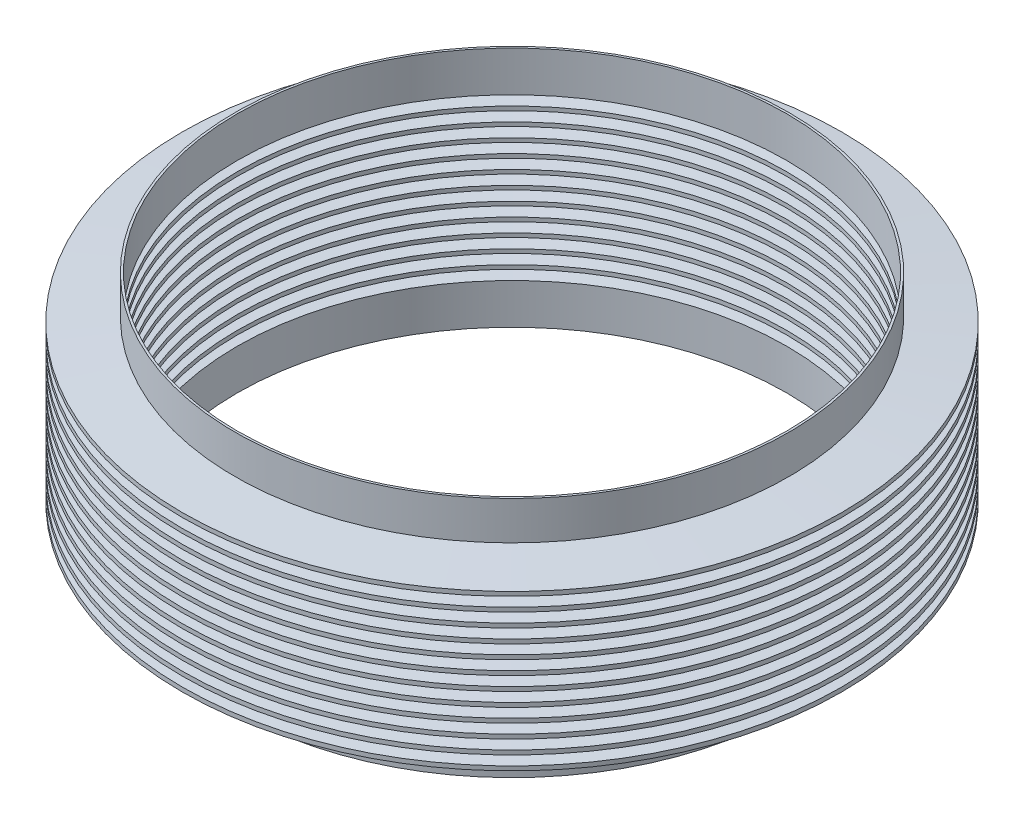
ISO-10303-21;
HEADER;
FILE_DESCRIPTION(('STEP AP214'),'2;1');
FILE_NAME('part.step','',(''),(''),'','','');
FILE_SCHEMA(('AUTOMOTIVE_DESIGN { 1 0 10303 214 1 1 1 1 }'));
ENDSEC;
DATA;
#1=APPLICATION_CONTEXT('core data for automotive mechanical design processes');
#2=APPLICATION_PROTOCOL_DEFINITION('international standard','automotive_design',2000,#1);
#3=PRODUCT_CONTEXT('',#1,'mechanical');
#4=PRODUCT('Part','Part','',(#3));
#5=PRODUCT_RELATED_PRODUCT_CATEGORY('part','',(#4));
#6=PRODUCT_DEFINITION_FORMATION('','',#4);
#7=PRODUCT_DEFINITION_CONTEXT('part definition',#1,'design');
#8=PRODUCT_DEFINITION('design','',#6,#7);
#9=PRODUCT_DEFINITION_SHAPE('','',#8);
#10=(LENGTH_UNIT() NAMED_UNIT(*) SI_UNIT(.MILLI.,.METRE.));
#11=(NAMED_UNIT(*) PLANE_ANGLE_UNIT() SI_UNIT($,.RADIAN.));
#12=(NAMED_UNIT(*) SI_UNIT($,.STERADIAN.) SOLID_ANGLE_UNIT());
#13=UNCERTAINTY_MEASURE_WITH_UNIT(LENGTH_MEASURE(1.E-05),#10,'distance_accuracy_value','');
#14=(GEOMETRIC_REPRESENTATION_CONTEXT(3) GLOBAL_UNCERTAINTY_ASSIGNED_CONTEXT((#13)) GLOBAL_UNIT_ASSIGNED_CONTEXT((#10,
#11,#12)) REPRESENTATION_CONTEXT('',''));
#15=CARTESIAN_POINT('',(0.,0.,0.));
#16=DIRECTION('',(0.,0.,1.));
#17=DIRECTION('',(1.,0.,0.));
#18=AXIS2_PLACEMENT_3D('',#15,#16,#17);
#19=CARTESIAN_POINT('',(0.,65.405,0.));
#20=DIRECTION('',(0.,-1.,0.));
#21=DIRECTION('',(0.,0.,-1.));
#22=AXIS2_PLACEMENT_3D('',#19,#20,#21);
#23=CONICAL_SURFACE('',#22,152.071320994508,1.48145249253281);
#24=CARTESIAN_POINT('',(0.,67.6509470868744,0.));
#25=DIRECTION('',(0.,-1.,0.));
#26=DIRECTION('',(0.,0.,-1.));
#27=AXIS2_PLACEMENT_3D('',#24,#25,#26);
#28=CIRCLE('',#27,127.);
#29=CARTESIAN_POINT('',(0.,67.6509470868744,-127.));
#30=VERTEX_POINT('',#29);
#31=EDGE_CURVE('E268',#30,#30,#28,.T.);
#32=ORIENTED_EDGE('',*,*,#31,.F.);
#33=EDGE_LOOP('',(#32));
#34=FACE_BOUND('',#33,.T.);
#35=CARTESIAN_POINT('',(0.,65.405,0.));
#36=DIRECTION('',(0.,-1.,0.));
#37=DIRECTION('',(0.,0.,-1.));
#38=AXIS2_PLACEMENT_3D('',#35,#36,#37);
#39=CIRCLE('',#38,152.071320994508);
#40=CARTESIAN_POINT('',(0.,65.405,-152.071320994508));
#41=VERTEX_POINT('',#40);
#42=EDGE_CURVE('E10',#41,#41,#39,.T.);
#43=ORIENTED_EDGE('',*,*,#42,.T.);
#44=EDGE_LOOP('',(#43));
#45=FACE_BOUND('',#44,.T.);
#46=ADVANCED_FACE('F33',(#34,#45),#23,.F.);
#47=CARTESIAN_POINT('',(0.,63.1590529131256,0.));
#48=DIRECTION('',(0.,1.,0.));
#49=DIRECTION('',(0.,0.,1.));
#50=AXIS2_PLACEMENT_3D('',#47,#48,#49);
#51=CONICAL_SURFACE('',#50,127.,1.48145249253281);
#52=ORIENTED_EDGE('',*,*,#42,.F.);
#53=EDGE_LOOP('',(#52));
#54=FACE_BOUND('',#53,.T.);
#55=CARTESIAN_POINT('',(0.,63.1590529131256,0.));
#56=DIRECTION('',(0.,-1.,0.));
#57=DIRECTION('',(0.,0.,-1.));
#58=AXIS2_PLACEMENT_3D('',#55,#56,#57);
#59=CIRCLE('',#58,127.);
#60=CARTESIAN_POINT('',(0.,63.1590529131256,-127.));
#61=VERTEX_POINT('',#60);
#62=EDGE_CURVE('E39',#61,#61,#59,.T.);
#63=ORIENTED_EDGE('',*,*,#62,.T.);
#64=EDGE_LOOP('',(#63));
#65=FACE_BOUND('',#64,.T.);
#66=ADVANCED_FACE('F275',(#54,#65),#51,.F.);
#67=CARTESIAN_POINT('',(0.,0.,0.));
#68=DIRECTION('',(0.,-1.,0.));
#69=DIRECTION('',(0.,0.,-1.));
#70=AXIS2_PLACEMENT_3D('',#67,#68,#69);
#71=CYLINDRICAL_SURFACE('',#70,127.);
#72=ORIENTED_EDGE('',*,*,#62,.F.);
#73=EDGE_LOOP('',(#72));
#74=FACE_BOUND('',#73,.T.);
#75=CARTESIAN_POINT('',(0.,61.3009470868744,0.));
#76=DIRECTION('',(0.,-1.,0.));
#77=DIRECTION('',(0.,0.,-1.));
#78=AXIS2_PLACEMENT_3D('',#75,#76,#77);
#79=CIRCLE('',#78,127.);
#80=CARTESIAN_POINT('',(0.,61.3009470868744,-127.));
#81=VERTEX_POINT('',#80);
#82=EDGE_CURVE('E43',#81,#81,#79,.T.);
#83=ORIENTED_EDGE('',*,*,#82,.T.);
#84=EDGE_LOOP('',(#83));
#85=FACE_BOUND('',#84,.T.);
#86=ADVANCED_FACE('F279',(#74,#85),#71,.F.);
#87=CARTESIAN_POINT('',(0.,59.055,0.));
#88=DIRECTION('',(0.,-1.,0.));
#89=DIRECTION('',(0.,0.,-1.));
#90=AXIS2_PLACEMENT_3D('',#87,#88,#89);
#91=CONICAL_SURFACE('',#90,152.071320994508,1.48145249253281);
#92=ORIENTED_EDGE('',*,*,#82,.F.);
#93=EDGE_LOOP('',(#92));
#94=FACE_BOUND('',#93,.T.);
#95=CARTESIAN_POINT('',(0.,59.055,0.));
#96=DIRECTION('',(0.,-1.,0.));
#97=DIRECTION('',(0.,0.,-1.));
#98=AXIS2_PLACEMENT_3D('',#95,#96,#97);
#99=CIRCLE('',#98,152.071320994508);
#100=CARTESIAN_POINT('',(0.,59.055,-152.071320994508));
#101=VERTEX_POINT('',#100);
#102=EDGE_CURVE('E47',#101,#101,#99,.T.);
#103=ORIENTED_EDGE('',*,*,#102,.T.);
#104=EDGE_LOOP('',(#103));
#105=FACE_BOUND('',#104,.T.);
#106=ADVANCED_FACE('F284',(#94,#105),#91,.F.);
#107=CARTESIAN_POINT('',(0.,56.8090529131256,0.));
#108=DIRECTION('',(0.,1.,0.));
#109=DIRECTION('',(0.,0.,1.));
#110=AXIS2_PLACEMENT_3D('',#107,#108,#109);
#111=CONICAL_SURFACE('',#110,127.,1.48145249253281);
#112=ORIENTED_EDGE('',*,*,#102,.F.);
#113=EDGE_LOOP('',(#112));
#114=FACE_BOUND('',#113,.T.);
#115=CARTESIAN_POINT('',(0.,56.8090529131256,0.));
#116=DIRECTION('',(0.,-1.,0.));
#117=DIRECTION('',(0.,0.,-1.));
#118=AXIS2_PLACEMENT_3D('',#115,#116,#117);
#119=CIRCLE('',#118,127.);
#120=CARTESIAN_POINT('',(0.,56.8090529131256,-127.));
#121=VERTEX_POINT('',#120);
#122=EDGE_CURVE('E52',#121,#121,#119,.T.);
#123=ORIENTED_EDGE('',*,*,#122,.T.);
#124=EDGE_LOOP('',(#123));
#125=FACE_BOUND('',#124,.T.);
#126=ADVANCED_FACE('F290',(#114,#125),#111,.F.);
#127=CARTESIAN_POINT('',(0.,0.,0.));
#128=DIRECTION('',(0.,-1.,0.));
#129=DIRECTION('',(0.,0.,-1.));
#130=AXIS2_PLACEMENT_3D('',#127,#128,#129);
#131=CYLINDRICAL_SURFACE('',#130,127.);
#132=ORIENTED_EDGE('',*,*,#122,.F.);
#133=EDGE_LOOP('',(#132));
#134=FACE_BOUND('',#133,.T.);
#135=CARTESIAN_POINT('',(0.,54.9509470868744,0.));
#136=DIRECTION('',(0.,-1.,0.));
#137=DIRECTION('',(0.,0.,-1.));
#138=AXIS2_PLACEMENT_3D('',#135,#136,#137);
#139=CIRCLE('',#138,127.);
#140=CARTESIAN_POINT('',(0.,54.9509470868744,-127.));
#141=VERTEX_POINT('',#140);
#142=EDGE_CURVE('E55',#141,#141,#139,.T.);
#143=ORIENTED_EDGE('',*,*,#142,.T.);
#144=EDGE_LOOP('',(#143));
#145=FACE_BOUND('',#144,.T.);
#146=ADVANCED_FACE('F294',(#134,#145),#131,.F.);
#147=CARTESIAN_POINT('',(0.,52.705,0.));
#148=DIRECTION('',(0.,-1.,0.));
#149=DIRECTION('',(0.,0.,-1.));
#150=AXIS2_PLACEMENT_3D('',#147,#148,#149);
#151=CONICAL_SURFACE('',#150,152.071320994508,1.48145249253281);
#152=ORIENTED_EDGE('',*,*,#142,.F.);
#153=EDGE_LOOP('',(#152));
#154=FACE_BOUND('',#153,.T.);
#155=CARTESIAN_POINT('',(0.,52.705,0.));
#156=DIRECTION('',(0.,-1.,0.));
#157=DIRECTION('',(0.,0.,-1.));
#158=AXIS2_PLACEMENT_3D('',#155,#156,#157);
#159=CIRCLE('',#158,152.071320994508);
#160=CARTESIAN_POINT('',(0.,52.705,-152.071320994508));
#161=VERTEX_POINT('',#160);
#162=EDGE_CURVE('E58',#161,#161,#159,.T.);
#163=ORIENTED_EDGE('',*,*,#162,.T.);
#164=EDGE_LOOP('',(#163));
#165=FACE_BOUND('',#164,.T.);
#166=ADVANCED_FACE('F298',(#154,#165),#151,.F.);
#167=CARTESIAN_POINT('',(0.,50.4590529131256,0.));
#168=DIRECTION('',(0.,1.,0.));
#169=DIRECTION('',(0.,0.,1.));
#170=AXIS2_PLACEMENT_3D('',#167,#168,#169);
#171=CONICAL_SURFACE('',#170,127.,1.48145249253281);
#172=ORIENTED_EDGE('',*,*,#162,.F.);
#173=EDGE_LOOP('',(#172));
#174=FACE_BOUND('',#173,.T.);
#175=CARTESIAN_POINT('',(0.,50.4590529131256,0.));
#176=DIRECTION('',(0.,-1.,0.));
#177=DIRECTION('',(0.,0.,-1.));
#178=AXIS2_PLACEMENT_3D('',#175,#176,#177);
#179=CIRCLE('',#178,127.);
#180=CARTESIAN_POINT('',(0.,50.4590529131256,-127.));
#181=VERTEX_POINT('',#180);
#182=EDGE_CURVE('E61',#181,#181,#179,.T.);
#183=ORIENTED_EDGE('',*,*,#182,.T.);
#184=EDGE_LOOP('',(#183));
#185=FACE_BOUND('',#184,.T.);
#186=ADVANCED_FACE('F302',(#174,#185),#171,.F.);
#187=CARTESIAN_POINT('',(0.,0.,0.));
#188=DIRECTION('',(0.,-1.,0.));
#189=DIRECTION('',(0.,0.,-1.));
#190=AXIS2_PLACEMENT_3D('',#187,#188,#189);
#191=CYLINDRICAL_SURFACE('',#190,127.);
#192=ORIENTED_EDGE('',*,*,#182,.F.);
#193=EDGE_LOOP('',(#192));
#194=FACE_BOUND('',#193,.T.);
#195=CARTESIAN_POINT('',(0.,48.6009470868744,0.));
#196=DIRECTION('',(0.,-1.,0.));
#197=DIRECTION('',(0.,0.,-1.));
#198=AXIS2_PLACEMENT_3D('',#195,#196,#197);
#199=CIRCLE('',#198,127.);
#200=CARTESIAN_POINT('',(0.,48.6009470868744,-127.));
#201=VERTEX_POINT('',#200);
#202=EDGE_CURVE('E64',#201,#201,#199,.T.);
#203=ORIENTED_EDGE('',*,*,#202,.T.);
#204=EDGE_LOOP('',(#203));
#205=FACE_BOUND('',#204,.T.);
#206=ADVANCED_FACE('F306',(#194,#205),#191,.F.);
#207=CARTESIAN_POINT('',(0.,46.355,0.));
#208=DIRECTION('',(0.,-1.,0.));
#209=DIRECTION('',(0.,0.,-1.));
#210=AXIS2_PLACEMENT_3D('',#207,#208,#209);
#211=CONICAL_SURFACE('',#210,152.071320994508,1.48145249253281);
#212=ORIENTED_EDGE('',*,*,#202,.F.);
#213=EDGE_LOOP('',(#212));
#214=FACE_BOUND('',#213,.T.);
#215=CARTESIAN_POINT('',(0.,46.355,0.));
#216=DIRECTION('',(0.,-1.,0.));
#217=DIRECTION('',(0.,0.,-1.));
#218=AXIS2_PLACEMENT_3D('',#215,#216,#217);
#219=CIRCLE('',#218,152.071320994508);
#220=CARTESIAN_POINT('',(0.,46.355,-152.071320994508));
#221=VERTEX_POINT('',#220);
#222=EDGE_CURVE('E67',#221,#221,#219,.T.);
#223=ORIENTED_EDGE('',*,*,#222,.T.);
#224=EDGE_LOOP('',(#223));
#225=FACE_BOUND('',#224,.T.);
#226=ADVANCED_FACE('F310',(#214,#225),#211,.F.);
#227=CARTESIAN_POINT('',(0.,44.1090529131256,0.));
#228=DIRECTION('',(0.,1.,0.));
#229=DIRECTION('',(0.,0.,1.));
#230=AXIS2_PLACEMENT_3D('',#227,#228,#229);
#231=CONICAL_SURFACE('',#230,127.,1.48145249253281);
#232=ORIENTED_EDGE('',*,*,#222,.F.);
#233=EDGE_LOOP('',(#232));
#234=FACE_BOUND('',#233,.T.);
#235=CARTESIAN_POINT('',(0.,44.1090529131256,0.));
#236=DIRECTION('',(0.,-1.,0.));
#237=DIRECTION('',(0.,0.,-1.));
#238=AXIS2_PLACEMENT_3D('',#235,#236,#237);
#239=CIRCLE('',#238,127.);
#240=CARTESIAN_POINT('',(0.,44.1090529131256,-127.));
#241=VERTEX_POINT('',#240);
#242=EDGE_CURVE('E70',#241,#241,#239,.T.);
#243=ORIENTED_EDGE('',*,*,#242,.T.);
#244=EDGE_LOOP('',(#243));
#245=FACE_BOUND('',#244,.T.);
#246=ADVANCED_FACE('F314',(#234,#245),#231,.F.);
#247=CARTESIAN_POINT('',(0.,0.,0.));
#248=DIRECTION('',(0.,-1.,0.));
#249=DIRECTION('',(0.,0.,-1.));
#250=AXIS2_PLACEMENT_3D('',#247,#248,#249);
#251=CYLINDRICAL_SURFACE('',#250,127.);
#252=ORIENTED_EDGE('',*,*,#242,.F.);
#253=EDGE_LOOP('',(#252));
#254=FACE_BOUND('',#253,.T.);
#255=CARTESIAN_POINT('',(0.,42.2509470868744,0.));
#256=DIRECTION('',(0.,-1.,0.));
#257=DIRECTION('',(0.,0.,-1.));
#258=AXIS2_PLACEMENT_3D('',#255,#256,#257);
#259=CIRCLE('',#258,127.);
#260=CARTESIAN_POINT('',(0.,42.2509470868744,-127.));
#261=VERTEX_POINT('',#260);
#262=EDGE_CURVE('E73',#261,#261,#259,.T.);
#263=ORIENTED_EDGE('',*,*,#262,.T.);
#264=EDGE_LOOP('',(#263));
#265=FACE_BOUND('',#264,.T.);
#266=ADVANCED_FACE('F318',(#254,#265),#251,.F.);
#267=CARTESIAN_POINT('',(0.,40.005,0.));
#268=DIRECTION('',(0.,-1.,0.));
#269=DIRECTION('',(0.,0.,-1.));
#270=AXIS2_PLACEMENT_3D('',#267,#268,#269);
#271=CONICAL_SURFACE('',#270,152.071320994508,1.48145249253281);
#272=ORIENTED_EDGE('',*,*,#262,.F.);
#273=EDGE_LOOP('',(#272));
#274=FACE_BOUND('',#273,.T.);
#275=CARTESIAN_POINT('',(0.,40.005,0.));
#276=DIRECTION('',(0.,-1.,0.));
#277=DIRECTION('',(0.,0.,-1.));
#278=AXIS2_PLACEMENT_3D('',#275,#276,#277);
#279=CIRCLE('',#278,152.071320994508);
#280=CARTESIAN_POINT('',(0.,40.005,-152.071320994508));
#281=VERTEX_POINT('',#280);
#282=EDGE_CURVE('E76',#281,#281,#279,.T.);
#283=ORIENTED_EDGE('',*,*,#282,.T.);
#284=EDGE_LOOP('',(#283));
#285=FACE_BOUND('',#284,.T.);
#286=ADVANCED_FACE('F322',(#274,#285),#271,.F.);
#287=CARTESIAN_POINT('',(0.,37.7590529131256,0.));
#288=DIRECTION('',(0.,1.,0.));
#289=DIRECTION('',(0.,0.,1.));
#290=AXIS2_PLACEMENT_3D('',#287,#288,#289);
#291=CONICAL_SURFACE('',#290,127.,1.48145249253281);
#292=ORIENTED_EDGE('',*,*,#282,.F.);
#293=EDGE_LOOP('',(#292));
#294=FACE_BOUND('',#293,.T.);
#295=CARTESIAN_POINT('',(0.,37.7590529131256,0.));
#296=DIRECTION('',(0.,-1.,0.));
#297=DIRECTION('',(0.,0.,-1.));
#298=AXIS2_PLACEMENT_3D('',#295,#296,#297);
#299=CIRCLE('',#298,127.);
#300=CARTESIAN_POINT('',(0.,37.7590529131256,-127.));
#301=VERTEX_POINT('',#300);
#302=EDGE_CURVE('E79',#301,#301,#299,.T.);
#303=ORIENTED_EDGE('',*,*,#302,.T.);
#304=EDGE_LOOP('',(#303));
#305=FACE_BOUND('',#304,.T.);
#306=ADVANCED_FACE('F326',(#294,#305),#291,.F.);
#307=CARTESIAN_POINT('',(0.,0.,0.));
#308=DIRECTION('',(0.,-1.,0.));
#309=DIRECTION('',(0.,0.,-1.));
#310=AXIS2_PLACEMENT_3D('',#307,#308,#309);
#311=CYLINDRICAL_SURFACE('',#310,127.);
#312=ORIENTED_EDGE('',*,*,#302,.F.);
#313=EDGE_LOOP('',(#312));
#314=FACE_BOUND('',#313,.T.);
#315=CARTESIAN_POINT('',(0.,35.9009470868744,0.));
#316=DIRECTION('',(0.,-1.,0.));
#317=DIRECTION('',(0.,0.,-1.));
#318=AXIS2_PLACEMENT_3D('',#315,#316,#317);
#319=CIRCLE('',#318,127.);
#320=CARTESIAN_POINT('',(0.,35.9009470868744,-127.));
#321=VERTEX_POINT('',#320);
#322=EDGE_CURVE('E82',#321,#321,#319,.T.);
#323=ORIENTED_EDGE('',*,*,#322,.T.);
#324=EDGE_LOOP('',(#323));
#325=FACE_BOUND('',#324,.T.);
#326=ADVANCED_FACE('F330',(#314,#325),#311,.F.);
#327=CARTESIAN_POINT('',(0.,33.655,0.));
#328=DIRECTION('',(0.,-1.,0.));
#329=DIRECTION('',(0.,0.,-1.));
#330=AXIS2_PLACEMENT_3D('',#327,#328,#329);
#331=CONICAL_SURFACE('',#330,152.071320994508,1.48145249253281);
#332=ORIENTED_EDGE('',*,*,#322,.F.);
#333=EDGE_LOOP('',(#332));
#334=FACE_BOUND('',#333,.T.);
#335=CARTESIAN_POINT('',(0.,33.655,0.));
#336=DIRECTION('',(0.,-1.,0.));
#337=DIRECTION('',(0.,0.,-1.));
#338=AXIS2_PLACEMENT_3D('',#335,#336,#337);
#339=CIRCLE('',#338,152.071320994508);
#340=CARTESIAN_POINT('',(0.,33.655,-152.071320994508));
#341=VERTEX_POINT('',#340);
#342=EDGE_CURVE('E85',#341,#341,#339,.T.);
#343=ORIENTED_EDGE('',*,*,#342,.T.);
#344=EDGE_LOOP('',(#343));
#345=FACE_BOUND('',#344,.T.);
#346=ADVANCED_FACE('F334',(#334,#345),#331,.F.);
#347=CARTESIAN_POINT('',(0.,31.4090529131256,0.));
#348=DIRECTION('',(0.,1.,0.));
#349=DIRECTION('',(0.,0.,1.));
#350=AXIS2_PLACEMENT_3D('',#347,#348,#349);
#351=CONICAL_SURFACE('',#350,127.,1.48145249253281);
#352=ORIENTED_EDGE('',*,*,#342,.F.);
#353=EDGE_LOOP('',(#352));
#354=FACE_BOUND('',#353,.T.);
#355=CARTESIAN_POINT('',(0.,31.4090529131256,0.));
#356=DIRECTION('',(0.,-1.,0.));
#357=DIRECTION('',(0.,0.,-1.));
#358=AXIS2_PLACEMENT_3D('',#355,#356,#357);
#359=CIRCLE('',#358,127.);
#360=CARTESIAN_POINT('',(0.,31.4090529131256,-127.));
#361=VERTEX_POINT('',#360);
#362=EDGE_CURVE('E88',#361,#361,#359,.T.);
#363=ORIENTED_EDGE('',*,*,#362,.T.);
#364=EDGE_LOOP('',(#363));
#365=FACE_BOUND('',#364,.T.);
#366=ADVANCED_FACE('F338',(#354,#365),#351,.F.);
#367=CARTESIAN_POINT('',(0.,0.,0.));
#368=DIRECTION('',(0.,-1.,0.));
#369=DIRECTION('',(0.,0.,-1.));
#370=AXIS2_PLACEMENT_3D('',#367,#368,#369);
#371=CYLINDRICAL_SURFACE('',#370,127.);
#372=ORIENTED_EDGE('',*,*,#362,.F.);
#373=EDGE_LOOP('',(#372));
#374=FACE_BOUND('',#373,.T.);
#375=CARTESIAN_POINT('',(0.,29.5509470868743,0.));
#376=DIRECTION('',(0.,-1.,0.));
#377=DIRECTION('',(0.,0.,-1.));
#378=AXIS2_PLACEMENT_3D('',#375,#376,#377);
#379=CIRCLE('',#378,127.);
#380=CARTESIAN_POINT('',(0.,29.5509470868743,-127.));
#381=VERTEX_POINT('',#380);
#382=EDGE_CURVE('E91',#381,#381,#379,.T.);
#383=ORIENTED_EDGE('',*,*,#382,.T.);
#384=EDGE_LOOP('',(#383));
#385=FACE_BOUND('',#384,.T.);
#386=ADVANCED_FACE('F342',(#374,#385),#371,.F.);
#387=CARTESIAN_POINT('',(0.,27.305,0.));
#388=DIRECTION('',(0.,-1.,0.));
#389=DIRECTION('',(0.,0.,-1.));
#390=AXIS2_PLACEMENT_3D('',#387,#388,#389);
#391=CONICAL_SURFACE('',#390,152.071320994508,1.48145249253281);
#392=ORIENTED_EDGE('',*,*,#382,.F.);
#393=EDGE_LOOP('',(#392));
#394=FACE_BOUND('',#393,.T.);
#395=CARTESIAN_POINT('',(0.,27.305,0.));
#396=DIRECTION('',(0.,-1.,0.));
#397=DIRECTION('',(0.,0.,-1.));
#398=AXIS2_PLACEMENT_3D('',#395,#396,#397);
#399=CIRCLE('',#398,152.071320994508);
#400=CARTESIAN_POINT('',(0.,27.305,-152.071320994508));
#401=VERTEX_POINT('',#400);
#402=EDGE_CURVE('E94',#401,#401,#399,.T.);
#403=ORIENTED_EDGE('',*,*,#402,.T.);
#404=EDGE_LOOP('',(#403));
#405=FACE_BOUND('',#404,.T.);
#406=ADVANCED_FACE('F346',(#394,#405),#391,.F.);
#407=CARTESIAN_POINT('',(0.,25.0590529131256,0.));
#408=DIRECTION('',(0.,1.,0.));
#409=DIRECTION('',(0.,0.,1.));
#410=AXIS2_PLACEMENT_3D('',#407,#408,#409);
#411=CONICAL_SURFACE('',#410,127.,1.48145249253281);
#412=ORIENTED_EDGE('',*,*,#402,.F.);
#413=EDGE_LOOP('',(#412));
#414=FACE_BOUND('',#413,.T.);
#415=CARTESIAN_POINT('',(0.,25.0590529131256,0.));
#416=DIRECTION('',(0.,-1.,0.));
#417=DIRECTION('',(0.,0.,-1.));
#418=AXIS2_PLACEMENT_3D('',#415,#416,#417);
#419=CIRCLE('',#418,127.);
#420=CARTESIAN_POINT('',(0.,25.0590529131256,-127.));
#421=VERTEX_POINT('',#420);
#422=EDGE_CURVE('E97',#421,#421,#419,.T.);
#423=ORIENTED_EDGE('',*,*,#422,.T.);
#424=EDGE_LOOP('',(#423));
#425=FACE_BOUND('',#424,.T.);
#426=ADVANCED_FACE('F350',(#414,#425),#411,.F.);
#427=CARTESIAN_POINT('',(0.,0.,0.));
#428=DIRECTION('',(0.,-1.,0.));
#429=DIRECTION('',(0.,0.,-1.));
#430=AXIS2_PLACEMENT_3D('',#427,#428,#429);
#431=CYLINDRICAL_SURFACE('',#430,127.);
#432=ORIENTED_EDGE('',*,*,#422,.F.);
#433=EDGE_LOOP('',(#432));
#434=FACE_BOUND('',#433,.T.);
#435=CARTESIAN_POINT('',(0.,23.2009470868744,0.));
#436=DIRECTION('',(0.,-1.,0.));
#437=DIRECTION('',(0.,0.,-1.));
#438=AXIS2_PLACEMENT_3D('',#435,#436,#437);
#439=CIRCLE('',#438,127.);
#440=CARTESIAN_POINT('',(0.,23.2009470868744,-127.));
#441=VERTEX_POINT('',#440);
#442=EDGE_CURVE('E100',#441,#441,#439,.T.);
#443=ORIENTED_EDGE('',*,*,#442,.T.);
#444=EDGE_LOOP('',(#443));
#445=FACE_BOUND('',#444,.T.);
#446=ADVANCED_FACE('F354',(#434,#445),#431,.F.);
#447=CARTESIAN_POINT('',(0.,20.955,0.));
#448=DIRECTION('',(0.,-1.,0.));
#449=DIRECTION('',(0.,0.,-1.));
#450=AXIS2_PLACEMENT_3D('',#447,#448,#449);
#451=CONICAL_SURFACE('',#450,152.071320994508,1.48145249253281);
#452=ORIENTED_EDGE('',*,*,#442,.F.);
#453=EDGE_LOOP('',(#452));
#454=FACE_BOUND('',#453,.T.);
#455=CARTESIAN_POINT('',(0.,20.955,0.));
#456=DIRECTION('',(0.,-1.,0.));
#457=DIRECTION('',(0.,0.,-1.));
#458=AXIS2_PLACEMENT_3D('',#455,#456,#457);
#459=CIRCLE('',#458,152.071320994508);
#460=CARTESIAN_POINT('',(0.,20.955,-152.071320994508));
#461=VERTEX_POINT('',#460);
#462=EDGE_CURVE('E103',#461,#461,#459,.T.);
#463=ORIENTED_EDGE('',*,*,#462,.T.);
#464=EDGE_LOOP('',(#463));
#465=FACE_BOUND('',#464,.T.);
#466=ADVANCED_FACE('F358',(#454,#465),#451,.F.);
#467=CARTESIAN_POINT('',(0.,18.7090529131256,0.));
#468=DIRECTION('',(0.,1.,0.));
#469=DIRECTION('',(0.,0.,1.));
#470=AXIS2_PLACEMENT_3D('',#467,#468,#469);
#471=CONICAL_SURFACE('',#470,127.,1.48145249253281);
#472=ORIENTED_EDGE('',*,*,#462,.F.);
#473=EDGE_LOOP('',(#472));
#474=FACE_BOUND('',#473,.T.);
#475=CARTESIAN_POINT('',(0.,18.7090529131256,0.));
#476=DIRECTION('',(0.,-1.,0.));
#477=DIRECTION('',(0.,0.,-1.));
#478=AXIS2_PLACEMENT_3D('',#475,#476,#477);
#479=CIRCLE('',#478,127.);
#480=CARTESIAN_POINT('',(0.,18.7090529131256,-127.));
#481=VERTEX_POINT('',#480);
#482=EDGE_CURVE('E106',#481,#481,#479,.T.);
#483=ORIENTED_EDGE('',*,*,#482,.T.);
#484=EDGE_LOOP('',(#483));
#485=FACE_BOUND('',#484,.T.);
#486=ADVANCED_FACE('F362',(#474,#485),#471,.F.);
#487=CARTESIAN_POINT('',(0.,0.,0.));
#488=DIRECTION('',(0.,-1.,0.));
#489=DIRECTION('',(0.,0.,-1.));
#490=AXIS2_PLACEMENT_3D('',#487,#488,#489);
#491=CYLINDRICAL_SURFACE('',#490,127.);
#492=ORIENTED_EDGE('',*,*,#482,.F.);
#493=EDGE_LOOP('',(#492));
#494=FACE_BOUND('',#493,.T.);
#495=CARTESIAN_POINT('',(0.,0.,0.));
#496=DIRECTION('',(0.,-1.,0.));
#497=DIRECTION('',(0.,0.,-1.));
#498=AXIS2_PLACEMENT_3D('',#495,#496,#497);
#499=CIRCLE('',#498,127.);
#500=CARTESIAN_POINT('',(0.,0.,-127.));
#501=VERTEX_POINT('',#500);
#502=EDGE_CURVE('E109',#501,#501,#499,.T.);
#503=ORIENTED_EDGE('',*,*,#502,.T.);
#504=EDGE_LOOP('',(#503));
#505=FACE_BOUND('',#504,.T.);
#506=ADVANCED_FACE('F366',(#494,#505),#491,.F.);
#507=CARTESIAN_POINT('',(-128.016,0.,0.));
#508=DIRECTION('',(0.,1.,0.));
#509=DIRECTION('',(0.,0.,1.));
#510=AXIS2_PLACEMENT_3D('',#507,#508,#509);
#511=PLANE('',#510);
#512=ORIENTED_EDGE('',*,*,#502,.F.);
#513=EDGE_LOOP('',(#512));
#514=FACE_BOUND('',#513,.T.);
#515=CARTESIAN_POINT('',(0.,0.,0.));
#516=DIRECTION('',(0.,-1.,0.));
#517=DIRECTION('',(0.,0.,-1.));
#518=AXIS2_PLACEMENT_3D('',#515,#516,#517);
#519=CIRCLE('',#518,128.016);
#520=CARTESIAN_POINT('',(0.,0.,-128.016));
#521=VERTEX_POINT('',#520);
#522=EDGE_CURVE('E112',#521,#521,#519,.T.);
#523=ORIENTED_EDGE('',*,*,#522,.T.);
#524=EDGE_LOOP('',(#523));
#525=FACE_BOUND('',#524,.T.);
#526=ADVANCED_FACE('F370',(#514,#525),#511,.F.);
#527=CARTESIAN_POINT('',(0.,0.,0.));
#528=DIRECTION('',(0.,-1.,0.));
#529=DIRECTION('',(0.,0.,-1.));
#530=AXIS2_PLACEMENT_3D('',#527,#528,#529);
#531=CYLINDRICAL_SURFACE('',#530,128.016);
#532=ORIENTED_EDGE('',*,*,#522,.F.);
#533=EDGE_LOOP('',(#532));
#534=FACE_BOUND('',#533,.T.);
#535=CARTESIAN_POINT('',(0.,17.78,0.));
#536=DIRECTION('',(0.,-1.,0.));
#537=DIRECTION('',(0.,0.,-1.));
#538=AXIS2_PLACEMENT_3D('',#535,#536,#537);
#539=CIRCLE('',#538,128.016);
#540=CARTESIAN_POINT('',(0.,17.78,-128.016));
#541=VERTEX_POINT('',#540);
#542=EDGE_CURVE('E115',#541,#541,#539,.T.);
#543=ORIENTED_EDGE('',*,*,#542,.T.);
#544=EDGE_LOOP('',(#543));
#545=FACE_BOUND('',#544,.T.);
#546=ADVANCED_FACE('F374',(#534,#545),#531,.T.);
#547=CARTESIAN_POINT('',(0.,19.9643752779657,0.));
#548=DIRECTION('',(0.,1.,0.));
#549=DIRECTION('',(0.,0.,1.));
#550=AXIS2_PLACEMENT_3D('',#547,#548,#549);
#551=CONICAL_SURFACE('',#550,152.4,1.48145249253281);
#552=ORIENTED_EDGE('',*,*,#542,.F.);
#553=EDGE_LOOP('',(#552));
#554=FACE_BOUND('',#553,.T.);
#555=CARTESIAN_POINT('',(0.,19.9643752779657,0.));
#556=DIRECTION('',(0.,-1.,0.));
#557=DIRECTION('',(0.,0.,-1.));
#558=AXIS2_PLACEMENT_3D('',#555,#556,#557);
#559=CIRCLE('',#558,152.4);
#560=CARTESIAN_POINT('',(0.,19.9643752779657,-152.4));
#561=VERTEX_POINT('',#560);
#562=EDGE_CURVE('E118',#561,#561,#559,.T.);
#563=ORIENTED_EDGE('',*,*,#562,.T.);
#564=EDGE_LOOP('',(#563));
#565=FACE_BOUND('',#564,.T.);
#566=ADVANCED_FACE('F378',(#554,#565),#551,.T.);
#567=CARTESIAN_POINT('',(0.,0.,0.));
#568=DIRECTION('',(0.,-1.,0.));
#569=DIRECTION('',(0.,0.,-1.));
#570=AXIS2_PLACEMENT_3D('',#567,#568,#569);
#571=CYLINDRICAL_SURFACE('',#570,152.4);
#572=ORIENTED_EDGE('',*,*,#562,.F.);
#573=EDGE_LOOP('',(#572));
#574=FACE_BOUND('',#573,.T.);
#575=CARTESIAN_POINT('',(0.,21.9456247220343,0.));
#576=DIRECTION('',(0.,-1.,0.));
#577=DIRECTION('',(0.,0.,-1.));
#578=AXIS2_PLACEMENT_3D('',#575,#576,#577);
#579=CIRCLE('',#578,152.4);
#580=CARTESIAN_POINT('',(0.,21.9456247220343,-152.4));
#581=VERTEX_POINT('',#580);
#582=EDGE_CURVE('E121',#581,#581,#579,.T.);
#583=ORIENTED_EDGE('',*,*,#582,.T.);
#584=EDGE_LOOP('',(#583));
#585=FACE_BOUND('',#584,.T.);
#586=ADVANCED_FACE('F382',(#574,#585),#571,.T.);
#587=CARTESIAN_POINT('',(0.,24.13,0.));
#588=DIRECTION('',(0.,-1.,0.));
#589=DIRECTION('',(0.,0.,-1.));
#590=AXIS2_PLACEMENT_3D('',#587,#588,#589);
#591=CONICAL_SURFACE('',#590,128.016,1.48145249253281);
#592=ORIENTED_EDGE('',*,*,#582,.F.);
#593=EDGE_LOOP('',(#592));
#594=FACE_BOUND('',#593,.T.);
#595=CARTESIAN_POINT('',(0.,24.13,0.));
#596=DIRECTION('',(0.,-1.,0.));
#597=DIRECTION('',(0.,0.,-1.));
#598=AXIS2_PLACEMENT_3D('',#595,#596,#597);
#599=CIRCLE('',#598,128.016);
#600=CARTESIAN_POINT('',(0.,24.13,-128.016));
#601=VERTEX_POINT('',#600);
#602=EDGE_CURVE('E124',#601,#601,#599,.T.);
#603=ORIENTED_EDGE('',*,*,#602,.T.);
#604=EDGE_LOOP('',(#603));
#605=FACE_BOUND('',#604,.T.);
#606=ADVANCED_FACE('F386',(#594,#605),#591,.T.);
#607=CARTESIAN_POINT('',(0.,26.3143752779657,0.));
#608=DIRECTION('',(0.,1.,0.));
#609=DIRECTION('',(0.,0.,1.));
#610=AXIS2_PLACEMENT_3D('',#607,#608,#609);
#611=CONICAL_SURFACE('',#610,152.4,1.48145249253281);
#612=ORIENTED_EDGE('',*,*,#602,.F.);
#613=EDGE_LOOP('',(#612));
#614=FACE_BOUND('',#613,.T.);
#615=CARTESIAN_POINT('',(0.,26.3143752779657,0.));
#616=DIRECTION('',(0.,-1.,0.));
#617=DIRECTION('',(0.,0.,-1.));
#618=AXIS2_PLACEMENT_3D('',#615,#616,#617);
#619=CIRCLE('',#618,152.4);
#620=CARTESIAN_POINT('',(0.,26.3143752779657,-152.4));
#621=VERTEX_POINT('',#620);
#622=EDGE_CURVE('E127',#621,#621,#619,.T.);
#623=ORIENTED_EDGE('',*,*,#622,.T.);
#624=EDGE_LOOP('',(#623));
#625=FACE_BOUND('',#624,.T.);
#626=ADVANCED_FACE('F390',(#614,#625),#611,.T.);
#627=CARTESIAN_POINT('',(0.,0.,0.));
#628=DIRECTION('',(0.,-1.,0.));
#629=DIRECTION('',(0.,0.,-1.));
#630=AXIS2_PLACEMENT_3D('',#627,#628,#629);
#631=CYLINDRICAL_SURFACE('',#630,152.4);
#632=ORIENTED_EDGE('',*,*,#622,.F.);
#633=EDGE_LOOP('',(#632));
#634=FACE_BOUND('',#633,.T.);
#635=CARTESIAN_POINT('',(0.,28.2956247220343,0.));
#636=DIRECTION('',(0.,-1.,0.));
#637=DIRECTION('',(0.,0.,-1.));
#638=AXIS2_PLACEMENT_3D('',#635,#636,#637);
#639=CIRCLE('',#638,152.4);
#640=CARTESIAN_POINT('',(0.,28.2956247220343,-152.4));
#641=VERTEX_POINT('',#640);
#642=EDGE_CURVE('E130',#641,#641,#639,.T.);
#643=ORIENTED_EDGE('',*,*,#642,.T.);
#644=EDGE_LOOP('',(#643));
#645=FACE_BOUND('',#644,.T.);
#646=ADVANCED_FACE('F394',(#634,#645),#631,.T.);
#647=CARTESIAN_POINT('',(0.,30.48,0.));
#648=DIRECTION('',(0.,-1.,0.));
#649=DIRECTION('',(0.,0.,-1.));
#650=AXIS2_PLACEMENT_3D('',#647,#648,#649);
#651=CONICAL_SURFACE('',#650,128.016,1.48145249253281);
#652=ORIENTED_EDGE('',*,*,#642,.F.);
#653=EDGE_LOOP('',(#652));
#654=FACE_BOUND('',#653,.T.);
#655=CARTESIAN_POINT('',(0.,30.48,0.));
#656=DIRECTION('',(0.,-1.,0.));
#657=DIRECTION('',(0.,0.,-1.));
#658=AXIS2_PLACEMENT_3D('',#655,#656,#657);
#659=CIRCLE('',#658,128.016);
#660=CARTESIAN_POINT('',(0.,30.48,-128.016));
#661=VERTEX_POINT('',#660);
#662=EDGE_CURVE('E133',#661,#661,#659,.T.);
#663=ORIENTED_EDGE('',*,*,#662,.T.);
#664=EDGE_LOOP('',(#663));
#665=FACE_BOUND('',#664,.T.);
#666=ADVANCED_FACE('F398',(#654,#665),#651,.T.);
#667=CARTESIAN_POINT('',(0.,32.6643752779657,0.));
#668=DIRECTION('',(0.,1.,0.));
#669=DIRECTION('',(0.,0.,1.));
#670=AXIS2_PLACEMENT_3D('',#667,#668,#669);
#671=CONICAL_SURFACE('',#670,152.4,1.48145249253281);
#672=ORIENTED_EDGE('',*,*,#662,.F.);
#673=EDGE_LOOP('',(#672));
#674=FACE_BOUND('',#673,.T.);
#675=CARTESIAN_POINT('',(0.,32.6643752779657,0.));
#676=DIRECTION('',(0.,-1.,0.));
#677=DIRECTION('',(0.,0.,-1.));
#678=AXIS2_PLACEMENT_3D('',#675,#676,#677);
#679=CIRCLE('',#678,152.4);
#680=CARTESIAN_POINT('',(0.,32.6643752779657,-152.4));
#681=VERTEX_POINT('',#680);
#682=EDGE_CURVE('E136',#681,#681,#679,.T.);
#683=ORIENTED_EDGE('',*,*,#682,.T.);
#684=EDGE_LOOP('',(#683));
#685=FACE_BOUND('',#684,.T.);
#686=ADVANCED_FACE('F402',(#674,#685),#671,.T.);
#687=CARTESIAN_POINT('',(0.,0.,0.));
#688=DIRECTION('',(0.,-1.,0.));
#689=DIRECTION('',(0.,0.,-1.));
#690=AXIS2_PLACEMENT_3D('',#687,#688,#689);
#691=CYLINDRICAL_SURFACE('',#690,152.4);
#692=ORIENTED_EDGE('',*,*,#682,.F.);
#693=EDGE_LOOP('',(#692));
#694=FACE_BOUND('',#693,.T.);
#695=CARTESIAN_POINT('',(0.,34.6456247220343,0.));
#696=DIRECTION('',(0.,-1.,0.));
#697=DIRECTION('',(0.,0.,-1.));
#698=AXIS2_PLACEMENT_3D('',#695,#696,#697);
#699=CIRCLE('',#698,152.4);
#700=CARTESIAN_POINT('',(0.,34.6456247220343,-152.4));
#701=VERTEX_POINT('',#700);
#702=EDGE_CURVE('E139',#701,#701,#699,.T.);
#703=ORIENTED_EDGE('',*,*,#702,.T.);
#704=EDGE_LOOP('',(#703));
#705=FACE_BOUND('',#704,.T.);
#706=ADVANCED_FACE('F406',(#694,#705),#691,.T.);
#707=CARTESIAN_POINT('',(0.,36.83,0.));
#708=DIRECTION('',(0.,-1.,0.));
#709=DIRECTION('',(0.,0.,-1.));
#710=AXIS2_PLACEMENT_3D('',#707,#708,#709);
#711=CONICAL_SURFACE('',#710,128.016,1.48145249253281);
#712=ORIENTED_EDGE('',*,*,#702,.F.);
#713=EDGE_LOOP('',(#712));
#714=FACE_BOUND('',#713,.T.);
#715=CARTESIAN_POINT('',(0.,36.83,0.));
#716=DIRECTION('',(0.,-1.,0.));
#717=DIRECTION('',(0.,0.,-1.));
#718=AXIS2_PLACEMENT_3D('',#715,#716,#717);
#719=CIRCLE('',#718,128.016);
#720=CARTESIAN_POINT('',(0.,36.83,-128.016));
#721=VERTEX_POINT('',#720);
#722=EDGE_CURVE('E142',#721,#721,#719,.T.);
#723=ORIENTED_EDGE('',*,*,#722,.T.);
#724=EDGE_LOOP('',(#723));
#725=FACE_BOUND('',#724,.T.);
#726=ADVANCED_FACE('F410',(#714,#725),#711,.T.);
#727=CARTESIAN_POINT('',(0.,39.0143752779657,0.));
#728=DIRECTION('',(0.,1.,0.));
#729=DIRECTION('',(0.,0.,1.));
#730=AXIS2_PLACEMENT_3D('',#727,#728,#729);
#731=CONICAL_SURFACE('',#730,152.4,1.48145249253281);
#732=ORIENTED_EDGE('',*,*,#722,.F.);
#733=EDGE_LOOP('',(#732));
#734=FACE_BOUND('',#733,.T.);
#735=CARTESIAN_POINT('',(0.,39.0143752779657,0.));
#736=DIRECTION('',(0.,-1.,0.));
#737=DIRECTION('',(0.,0.,-1.));
#738=AXIS2_PLACEMENT_3D('',#735,#736,#737);
#739=CIRCLE('',#738,152.4);
#740=CARTESIAN_POINT('',(0.,39.0143752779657,-152.4));
#741=VERTEX_POINT('',#740);
#742=EDGE_CURVE('E145',#741,#741,#739,.T.);
#743=ORIENTED_EDGE('',*,*,#742,.T.);
#744=EDGE_LOOP('',(#743));
#745=FACE_BOUND('',#744,.T.);
#746=ADVANCED_FACE('F414',(#734,#745),#731,.T.);
#747=CARTESIAN_POINT('',(0.,0.,0.));
#748=DIRECTION('',(0.,-1.,0.));
#749=DIRECTION('',(0.,0.,-1.));
#750=AXIS2_PLACEMENT_3D('',#747,#748,#749);
#751=CYLINDRICAL_SURFACE('',#750,152.4);
#752=ORIENTED_EDGE('',*,*,#742,.F.);
#753=EDGE_LOOP('',(#752));
#754=FACE_BOUND('',#753,.T.);
#755=CARTESIAN_POINT('',(0.,40.9956247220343,0.));
#756=DIRECTION('',(0.,-1.,0.));
#757=DIRECTION('',(0.,0.,-1.));
#758=AXIS2_PLACEMENT_3D('',#755,#756,#757);
#759=CIRCLE('',#758,152.4);
#760=CARTESIAN_POINT('',(0.,40.9956247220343,-152.4));
#761=VERTEX_POINT('',#760);
#762=EDGE_CURVE('E148',#761,#761,#759,.T.);
#763=ORIENTED_EDGE('',*,*,#762,.T.);
#764=EDGE_LOOP('',(#763));
#765=FACE_BOUND('',#764,.T.);
#766=ADVANCED_FACE('F418',(#754,#765),#751,.T.);
#767=CARTESIAN_POINT('',(0.,43.18,0.));
#768=DIRECTION('',(0.,-1.,0.));
#769=DIRECTION('',(0.,0.,-1.));
#770=AXIS2_PLACEMENT_3D('',#767,#768,#769);
#771=CONICAL_SURFACE('',#770,128.016,1.48145249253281);
#772=ORIENTED_EDGE('',*,*,#762,.F.);
#773=EDGE_LOOP('',(#772));
#774=FACE_BOUND('',#773,.T.);
#775=CARTESIAN_POINT('',(0.,43.18,0.));
#776=DIRECTION('',(0.,-1.,0.));
#777=DIRECTION('',(0.,0.,-1.));
#778=AXIS2_PLACEMENT_3D('',#775,#776,#777);
#779=CIRCLE('',#778,128.016);
#780=CARTESIAN_POINT('',(0.,43.18,-128.016));
#781=VERTEX_POINT('',#780);
#782=EDGE_CURVE('E151',#781,#781,#779,.T.);
#783=ORIENTED_EDGE('',*,*,#782,.T.);
#784=EDGE_LOOP('',(#783));
#785=FACE_BOUND('',#784,.T.);
#786=ADVANCED_FACE('F422',(#774,#785),#771,.T.);
#787=CARTESIAN_POINT('',(0.,45.3643752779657,0.));
#788=DIRECTION('',(0.,1.,0.));
#789=DIRECTION('',(0.,0.,1.));
#790=AXIS2_PLACEMENT_3D('',#787,#788,#789);
#791=CONICAL_SURFACE('',#790,152.4,1.48145249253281);
#792=ORIENTED_EDGE('',*,*,#782,.F.);
#793=EDGE_LOOP('',(#792));
#794=FACE_BOUND('',#793,.T.);
#795=CARTESIAN_POINT('',(0.,45.3643752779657,0.));
#796=DIRECTION('',(0.,-1.,0.));
#797=DIRECTION('',(0.,0.,-1.));
#798=AXIS2_PLACEMENT_3D('',#795,#796,#797);
#799=CIRCLE('',#798,152.4);
#800=CARTESIAN_POINT('',(0.,45.3643752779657,-152.4));
#801=VERTEX_POINT('',#800);
#802=EDGE_CURVE('E154',#801,#801,#799,.T.);
#803=ORIENTED_EDGE('',*,*,#802,.T.);
#804=EDGE_LOOP('',(#803));
#805=FACE_BOUND('',#804,.T.);
#806=ADVANCED_FACE('F426',(#794,#805),#791,.T.);
#807=CARTESIAN_POINT('',(0.,0.,0.));
#808=DIRECTION('',(0.,-1.,0.));
#809=DIRECTION('',(0.,0.,-1.));
#810=AXIS2_PLACEMENT_3D('',#807,#808,#809);
#811=CYLINDRICAL_SURFACE('',#810,152.4);
#812=ORIENTED_EDGE('',*,*,#802,.F.);
#813=EDGE_LOOP('',(#812));
#814=FACE_BOUND('',#813,.T.);
#815=CARTESIAN_POINT('',(0.,47.3456247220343,0.));
#816=DIRECTION('',(0.,-1.,0.));
#817=DIRECTION('',(0.,0.,-1.));
#818=AXIS2_PLACEMENT_3D('',#815,#816,#817);
#819=CIRCLE('',#818,152.4);
#820=CARTESIAN_POINT('',(0.,47.3456247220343,-152.4));
#821=VERTEX_POINT('',#820);
#822=EDGE_CURVE('E157',#821,#821,#819,.T.);
#823=ORIENTED_EDGE('',*,*,#822,.T.);
#824=EDGE_LOOP('',(#823));
#825=FACE_BOUND('',#824,.T.);
#826=ADVANCED_FACE('F430',(#814,#825),#811,.T.);
#827=CARTESIAN_POINT('',(0.,49.53,0.));
#828=DIRECTION('',(0.,-1.,0.));
#829=DIRECTION('',(0.,0.,-1.));
#830=AXIS2_PLACEMENT_3D('',#827,#828,#829);
#831=CONICAL_SURFACE('',#830,128.016,1.48145249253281);
#832=ORIENTED_EDGE('',*,*,#822,.F.);
#833=EDGE_LOOP('',(#832));
#834=FACE_BOUND('',#833,.T.);
#835=CARTESIAN_POINT('',(0.,49.53,0.));
#836=DIRECTION('',(0.,-1.,0.));
#837=DIRECTION('',(0.,0.,-1.));
#838=AXIS2_PLACEMENT_3D('',#835,#836,#837);
#839=CIRCLE('',#838,128.016);
#840=CARTESIAN_POINT('',(0.,49.53,-128.016));
#841=VERTEX_POINT('',#840);
#842=EDGE_CURVE('E160',#841,#841,#839,.T.);
#843=ORIENTED_EDGE('',*,*,#842,.T.);
#844=EDGE_LOOP('',(#843));
#845=FACE_BOUND('',#844,.T.);
#846=ADVANCED_FACE('F434',(#834,#845),#831,.T.);
#847=CARTESIAN_POINT('',(0.,51.7143752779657,0.));
#848=DIRECTION('',(0.,1.,0.));
#849=DIRECTION('',(0.,0.,1.));
#850=AXIS2_PLACEMENT_3D('',#847,#848,#849);
#851=CONICAL_SURFACE('',#850,152.4,1.48145249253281);
#852=ORIENTED_EDGE('',*,*,#842,.F.);
#853=EDGE_LOOP('',(#852));
#854=FACE_BOUND('',#853,.T.);
#855=CARTESIAN_POINT('',(0.,51.7143752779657,0.));
#856=DIRECTION('',(0.,-1.,0.));
#857=DIRECTION('',(0.,0.,-1.));
#858=AXIS2_PLACEMENT_3D('',#855,#856,#857);
#859=CIRCLE('',#858,152.4);
#860=CARTESIAN_POINT('',(0.,51.7143752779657,-152.4));
#861=VERTEX_POINT('',#860);
#862=EDGE_CURVE('E163',#861,#861,#859,.T.);
#863=ORIENTED_EDGE('',*,*,#862,.T.);
#864=EDGE_LOOP('',(#863));
#865=FACE_BOUND('',#864,.T.);
#866=ADVANCED_FACE('F438',(#854,#865),#851,.T.);
#867=CARTESIAN_POINT('',(0.,0.,0.));
#868=DIRECTION('',(0.,-1.,0.));
#869=DIRECTION('',(0.,0.,-1.));
#870=AXIS2_PLACEMENT_3D('',#867,#868,#869);
#871=CYLINDRICAL_SURFACE('',#870,152.4);
#872=ORIENTED_EDGE('',*,*,#862,.F.);
#873=EDGE_LOOP('',(#872));
#874=FACE_BOUND('',#873,.T.);
#875=CARTESIAN_POINT('',(0.,53.6956247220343,0.));
#876=DIRECTION('',(0.,-1.,0.));
#877=DIRECTION('',(0.,0.,-1.));
#878=AXIS2_PLACEMENT_3D('',#875,#876,#877);
#879=CIRCLE('',#878,152.4);
#880=CARTESIAN_POINT('',(0.,53.6956247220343,-152.4));
#881=VERTEX_POINT('',#880);
#882=EDGE_CURVE('E166',#881,#881,#879,.T.);
#883=ORIENTED_EDGE('',*,*,#882,.T.);
#884=EDGE_LOOP('',(#883));
#885=FACE_BOUND('',#884,.T.);
#886=ADVANCED_FACE('F442',(#874,#885),#871,.T.);
#887=CARTESIAN_POINT('',(0.,55.88,0.));
#888=DIRECTION('',(0.,-1.,0.));
#889=DIRECTION('',(0.,0.,-1.));
#890=AXIS2_PLACEMENT_3D('',#887,#888,#889);
#891=CONICAL_SURFACE('',#890,128.016,1.48145249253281);
#892=ORIENTED_EDGE('',*,*,#882,.F.);
#893=EDGE_LOOP('',(#892));
#894=FACE_BOUND('',#893,.T.);
#895=CARTESIAN_POINT('',(0.,55.88,0.));
#896=DIRECTION('',(0.,-1.,0.));
#897=DIRECTION('',(0.,0.,-1.));
#898=AXIS2_PLACEMENT_3D('',#895,#896,#897);
#899=CIRCLE('',#898,128.016);
#900=CARTESIAN_POINT('',(0.,55.88,-128.016));
#901=VERTEX_POINT('',#900);
#902=EDGE_CURVE('E169',#901,#901,#899,.T.);
#903=ORIENTED_EDGE('',*,*,#902,.T.);
#904=EDGE_LOOP('',(#903));
#905=FACE_BOUND('',#904,.T.);
#906=ADVANCED_FACE('F446',(#894,#905),#891,.T.);
#907=CARTESIAN_POINT('',(0.,58.0643752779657,0.));
#908=DIRECTION('',(0.,1.,0.));
#909=DIRECTION('',(0.,0.,1.));
#910=AXIS2_PLACEMENT_3D('',#907,#908,#909);
#911=CONICAL_SURFACE('',#910,152.4,1.48145249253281);
#912=ORIENTED_EDGE('',*,*,#902,.F.);
#913=EDGE_LOOP('',(#912));
#914=FACE_BOUND('',#913,.T.);
#915=CARTESIAN_POINT('',(0.,58.0643752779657,0.));
#916=DIRECTION('',(0.,-1.,0.));
#917=DIRECTION('',(0.,0.,-1.));
#918=AXIS2_PLACEMENT_3D('',#915,#916,#917);
#919=CIRCLE('',#918,152.4);
#920=CARTESIAN_POINT('',(0.,58.0643752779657,-152.4));
#921=VERTEX_POINT('',#920);
#922=EDGE_CURVE('E172',#921,#921,#919,.T.);
#923=ORIENTED_EDGE('',*,*,#922,.T.);
#924=EDGE_LOOP('',(#923));
#925=FACE_BOUND('',#924,.T.);
#926=ADVANCED_FACE('F450',(#914,#925),#911,.T.);
#927=CARTESIAN_POINT('',(0.,0.,0.));
#928=DIRECTION('',(0.,-1.,0.));
#929=DIRECTION('',(0.,0.,-1.));
#930=AXIS2_PLACEMENT_3D('',#927,#928,#929);
#931=CYLINDRICAL_SURFACE('',#930,152.4);
#932=ORIENTED_EDGE('',*,*,#922,.F.);
#933=EDGE_LOOP('',(#932));
#934=FACE_BOUND('',#933,.T.);
#935=CARTESIAN_POINT('',(0.,60.0456247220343,0.));
#936=DIRECTION('',(0.,-1.,0.));
#937=DIRECTION('',(0.,0.,-1.));
#938=AXIS2_PLACEMENT_3D('',#935,#936,#937);
#939=CIRCLE('',#938,152.4);
#940=CARTESIAN_POINT('',(0.,60.0456247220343,-152.4));
#941=VERTEX_POINT('',#940);
#942=EDGE_CURVE('E175',#941,#941,#939,.T.);
#943=ORIENTED_EDGE('',*,*,#942,.T.);
#944=EDGE_LOOP('',(#943));
#945=FACE_BOUND('',#944,.T.);
#946=ADVANCED_FACE('F454',(#934,#945),#931,.T.);
#947=CARTESIAN_POINT('',(0.,62.23,0.));
#948=DIRECTION('',(0.,-1.,0.));
#949=DIRECTION('',(0.,0.,-1.));
#950=AXIS2_PLACEMENT_3D('',#947,#948,#949);
#951=CONICAL_SURFACE('',#950,128.016,1.48145249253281);
#952=ORIENTED_EDGE('',*,*,#942,.F.);
#953=EDGE_LOOP('',(#952));
#954=FACE_BOUND('',#953,.T.);
#955=CARTESIAN_POINT('',(0.,62.23,0.));
#956=DIRECTION('',(0.,-1.,0.));
#957=DIRECTION('',(0.,0.,-1.));
#958=AXIS2_PLACEMENT_3D('',#955,#956,#957);
#959=CIRCLE('',#958,128.016);
#960=CARTESIAN_POINT('',(0.,62.23,-128.016));
#961=VERTEX_POINT('',#960);
#962=EDGE_CURVE('E178',#961,#961,#959,.T.);
#963=ORIENTED_EDGE('',*,*,#962,.T.);
#964=EDGE_LOOP('',(#963));
#965=FACE_BOUND('',#964,.T.);
#966=ADVANCED_FACE('F458',(#954,#965),#951,.T.);
#967=CARTESIAN_POINT('',(0.,64.4143752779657,0.));
#968=DIRECTION('',(0.,1.,0.));
#969=DIRECTION('',(0.,0.,1.));
#970=AXIS2_PLACEMENT_3D('',#967,#968,#969);
#971=CONICAL_SURFACE('',#970,152.4,1.48145249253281);
#972=ORIENTED_EDGE('',*,*,#962,.F.);
#973=EDGE_LOOP('',(#972));
#974=FACE_BOUND('',#973,.T.);
#975=CARTESIAN_POINT('',(0.,64.4143752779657,0.));
#976=DIRECTION('',(0.,-1.,0.));
#977=DIRECTION('',(0.,0.,-1.));
#978=AXIS2_PLACEMENT_3D('',#975,#976,#977);
#979=CIRCLE('',#978,152.4);
#980=CARTESIAN_POINT('',(0.,64.4143752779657,-152.4));
#981=VERTEX_POINT('',#980);
#982=EDGE_CURVE('E181',#981,#981,#979,.T.);
#983=ORIENTED_EDGE('',*,*,#982,.T.);
#984=EDGE_LOOP('',(#983));
#985=FACE_BOUND('',#984,.T.);
#986=ADVANCED_FACE('F462',(#974,#985),#971,.T.);
#987=CARTESIAN_POINT('',(0.,0.,0.));
#988=DIRECTION('',(0.,-1.,0.));
#989=DIRECTION('',(0.,0.,-1.));
#990=AXIS2_PLACEMENT_3D('',#987,#988,#989);
#991=CYLINDRICAL_SURFACE('',#990,152.4);
#992=ORIENTED_EDGE('',*,*,#982,.F.);
#993=EDGE_LOOP('',(#992));
#994=FACE_BOUND('',#993,.T.);
#995=CARTESIAN_POINT('',(0.,66.3956247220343,0.));
#996=DIRECTION('',(0.,-1.,0.));
#997=DIRECTION('',(0.,0.,-1.));
#998=AXIS2_PLACEMENT_3D('',#995,#996,#997);
#999=CIRCLE('',#998,152.4);
#1000=CARTESIAN_POINT('',(0.,66.3956247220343,-152.4));
#1001=VERTEX_POINT('',#1000);
#1002=EDGE_CURVE('E184',#1001,#1001,#999,.T.);
#1003=ORIENTED_EDGE('',*,*,#1002,.T.);
#1004=EDGE_LOOP('',(#1003));
#1005=FACE_BOUND('',#1004,.T.);
#1006=ADVANCED_FACE('F466',(#994,#1005),#991,.T.);
#1007=CARTESIAN_POINT('',(0.,68.58,0.));
#1008=DIRECTION('',(0.,-1.,0.));
#1009=DIRECTION('',(0.,0.,-1.));
#1010=AXIS2_PLACEMENT_3D('',#1007,#1008,#1009);
#1011=CONICAL_SURFACE('',#1010,128.016,1.48145249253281);
#1012=ORIENTED_EDGE('',*,*,#1002,.F.);
#1013=EDGE_LOOP('',(#1012));
#1014=FACE_BOUND('',#1013,.T.);
#1015=CARTESIAN_POINT('',(0.,68.58,0.));
#1016=DIRECTION('',(0.,-1.,0.));
#1017=DIRECTION('',(0.,0.,-1.));
#1018=AXIS2_PLACEMENT_3D('',#1015,#1016,#1017);
#1019=CIRCLE('',#1018,128.016);
#1020=CARTESIAN_POINT('',(0.,68.58,-128.016));
#1021=VERTEX_POINT('',#1020);
#1022=EDGE_CURVE('E187',#1021,#1021,#1019,.T.);
#1023=ORIENTED_EDGE('',*,*,#1022,.T.);
#1024=EDGE_LOOP('',(#1023));
#1025=FACE_BOUND('',#1024,.T.);
#1026=ADVANCED_FACE('F470',(#1014,#1025),#1011,.T.);
#1027=CARTESIAN_POINT('',(0.,70.7643752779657,0.));
#1028=DIRECTION('',(0.,1.,0.));
#1029=DIRECTION('',(0.,0.,1.));
#1030=AXIS2_PLACEMENT_3D('',#1027,#1028,#1029);
#1031=CONICAL_SURFACE('',#1030,152.4,1.48145249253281);
#1032=ORIENTED_EDGE('',*,*,#1022,.F.);
#1033=EDGE_LOOP('',(#1032));
#1034=FACE_BOUND('',#1033,.T.);
#1035=CARTESIAN_POINT('',(0.,70.7643752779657,0.));
#1036=DIRECTION('',(0.,-1.,0.));
#1037=DIRECTION('',(0.,0.,-1.));
#1038=AXIS2_PLACEMENT_3D('',#1035,#1036,#1037);
#1039=CIRCLE('',#1038,152.4);
#1040=CARTESIAN_POINT('',(0.,70.7643752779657,-152.4));
#1041=VERTEX_POINT('',#1040);
#1042=EDGE_CURVE('E190',#1041,#1041,#1039,.T.);
#1043=ORIENTED_EDGE('',*,*,#1042,.T.);
#1044=EDGE_LOOP('',(#1043));
#1045=FACE_BOUND('',#1044,.T.);
#1046=ADVANCED_FACE('F474',(#1034,#1045),#1031,.T.);
#1047=CARTESIAN_POINT('',(0.,0.,0.));
#1048=DIRECTION('',(0.,-1.,0.));
#1049=DIRECTION('',(0.,0.,-1.));
#1050=AXIS2_PLACEMENT_3D('',#1047,#1048,#1049);
#1051=CYLINDRICAL_SURFACE('',#1050,152.4);
#1052=ORIENTED_EDGE('',*,*,#1042,.F.);
#1053=EDGE_LOOP('',(#1052));
#1054=FACE_BOUND('',#1053,.T.);
#1055=CARTESIAN_POINT('',(0.,72.7456247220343,0.));
#1056=DIRECTION('',(0.,-1.,0.));
#1057=DIRECTION('',(0.,0.,-1.));
#1058=AXIS2_PLACEMENT_3D('',#1055,#1056,#1057);
#1059=CIRCLE('',#1058,152.4);
#1060=CARTESIAN_POINT('',(0.,72.7456247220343,-152.4));
#1061=VERTEX_POINT('',#1060);
#1062=EDGE_CURVE('E193',#1061,#1061,#1059,.T.);
#1063=ORIENTED_EDGE('',*,*,#1062,.T.);
#1064=EDGE_LOOP('',(#1063));
#1065=FACE_BOUND('',#1064,.T.);
#1066=ADVANCED_FACE('F478',(#1054,#1065),#1051,.T.);
#1067=CARTESIAN_POINT('',(0.,74.93,0.));
#1068=DIRECTION('',(0.,-1.,0.));
#1069=DIRECTION('',(0.,0.,-1.));
#1070=AXIS2_PLACEMENT_3D('',#1067,#1068,#1069);
#1071=CONICAL_SURFACE('',#1070,128.016,1.48145249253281);
#1072=ORIENTED_EDGE('',*,*,#1062,.F.);
#1073=EDGE_LOOP('',(#1072));
#1074=FACE_BOUND('',#1073,.T.);
#1075=CARTESIAN_POINT('',(0.,74.93,0.));
#1076=DIRECTION('',(0.,-1.,0.));
#1077=DIRECTION('',(0.,0.,-1.));
#1078=AXIS2_PLACEMENT_3D('',#1075,#1076,#1077);
#1079=CIRCLE('',#1078,128.016);
#1080=CARTESIAN_POINT('',(0.,74.93,-128.016));
#1081=VERTEX_POINT('',#1080);
#1082=EDGE_CURVE('E196',#1081,#1081,#1079,.T.);
#1083=ORIENTED_EDGE('',*,*,#1082,.T.);
#1084=EDGE_LOOP('',(#1083));
#1085=FACE_BOUND('',#1084,.T.);
#1086=ADVANCED_FACE('F482',(#1074,#1085),#1071,.T.);
#1087=CARTESIAN_POINT('',(0.,77.1143752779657,0.));
#1088=DIRECTION('',(0.,1.,0.));
#1089=DIRECTION('',(0.,0.,1.));
#1090=AXIS2_PLACEMENT_3D('',#1087,#1088,#1089);
#1091=CONICAL_SURFACE('',#1090,152.4,1.48145249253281);
#1092=ORIENTED_EDGE('',*,*,#1082,.F.);
#1093=EDGE_LOOP('',(#1092));
#1094=FACE_BOUND('',#1093,.T.);
#1095=CARTESIAN_POINT('',(0.,77.1143752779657,0.));
#1096=DIRECTION('',(0.,-1.,0.));
#1097=DIRECTION('',(0.,0.,-1.));
#1098=AXIS2_PLACEMENT_3D('',#1095,#1096,#1097);
#1099=CIRCLE('',#1098,152.4);
#1100=CARTESIAN_POINT('',(0.,77.1143752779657,-152.4));
#1101=VERTEX_POINT('',#1100);
#1102=EDGE_CURVE('E199',#1101,#1101,#1099,.T.);
#1103=ORIENTED_EDGE('',*,*,#1102,.T.);
#1104=EDGE_LOOP('',(#1103));
#1105=FACE_BOUND('',#1104,.T.);
#1106=ADVANCED_FACE('F486',(#1094,#1105),#1091,.T.);
#1107=CARTESIAN_POINT('',(0.,0.,0.));
#1108=DIRECTION('',(0.,-1.,0.));
#1109=DIRECTION('',(0.,0.,-1.));
#1110=AXIS2_PLACEMENT_3D('',#1107,#1108,#1109);
#1111=CYLINDRICAL_SURFACE('',#1110,152.4);
#1112=ORIENTED_EDGE('',*,*,#1102,.F.);
#1113=EDGE_LOOP('',(#1112));
#1114=FACE_BOUND('',#1113,.T.);
#1115=CARTESIAN_POINT('',(0.,79.0956247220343,0.));
#1116=DIRECTION('',(0.,-1.,0.));
#1117=DIRECTION('',(0.,0.,-1.));
#1118=AXIS2_PLACEMENT_3D('',#1115,#1116,#1117);
#1119=CIRCLE('',#1118,152.4);
#1120=CARTESIAN_POINT('',(0.,79.0956247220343,-152.4));
#1121=VERTEX_POINT('',#1120);
#1122=EDGE_CURVE('E202',#1121,#1121,#1119,.T.);
#1123=ORIENTED_EDGE('',*,*,#1122,.T.);
#1124=EDGE_LOOP('',(#1123));
#1125=FACE_BOUND('',#1124,.T.);
#1126=ADVANCED_FACE('F490',(#1114,#1125),#1111,.T.);
#1127=CARTESIAN_POINT('',(0.,81.28,0.));
#1128=DIRECTION('',(0.,-1.,0.));
#1129=DIRECTION('',(0.,0.,-1.));
#1130=AXIS2_PLACEMENT_3D('',#1127,#1128,#1129);
#1131=CONICAL_SURFACE('',#1130,128.016,1.48145249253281);
#1132=ORIENTED_EDGE('',*,*,#1122,.F.);
#1133=EDGE_LOOP('',(#1132));
#1134=FACE_BOUND('',#1133,.T.);
#1135=CARTESIAN_POINT('',(0.,81.28,0.));
#1136=DIRECTION('',(0.,-1.,0.));
#1137=DIRECTION('',(0.,0.,-1.));
#1138=AXIS2_PLACEMENT_3D('',#1135,#1136,#1137);
#1139=CIRCLE('',#1138,128.016);
#1140=CARTESIAN_POINT('',(0.,81.28,-128.016));
#1141=VERTEX_POINT('',#1140);
#1142=EDGE_CURVE('E205',#1141,#1141,#1139,.T.);
#1143=ORIENTED_EDGE('',*,*,#1142,.T.);
#1144=EDGE_LOOP('',(#1143));
#1145=FACE_BOUND('',#1144,.T.);
#1146=ADVANCED_FACE('F494',(#1134,#1145),#1131,.T.);
#1147=CARTESIAN_POINT('',(0.,83.4643752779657,0.));
#1148=DIRECTION('',(0.,1.,0.));
#1149=DIRECTION('',(0.,0.,1.));
#1150=AXIS2_PLACEMENT_3D('',#1147,#1148,#1149);
#1151=CONICAL_SURFACE('',#1150,152.4,1.48145249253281);
#1152=ORIENTED_EDGE('',*,*,#1142,.F.);
#1153=EDGE_LOOP('',(#1152));
#1154=FACE_BOUND('',#1153,.T.);
#1155=CARTESIAN_POINT('',(0.,83.4643752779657,0.));
#1156=DIRECTION('',(0.,-1.,0.));
#1157=DIRECTION('',(0.,0.,-1.));
#1158=AXIS2_PLACEMENT_3D('',#1155,#1156,#1157);
#1159=CIRCLE('',#1158,152.4);
#1160=CARTESIAN_POINT('',(0.,83.4643752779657,-152.4));
#1161=VERTEX_POINT('',#1160);
#1162=EDGE_CURVE('E208',#1161,#1161,#1159,.T.);
#1163=ORIENTED_EDGE('',*,*,#1162,.T.);
#1164=EDGE_LOOP('',(#1163));
#1165=FACE_BOUND('',#1164,.T.);
#1166=ADVANCED_FACE('F498',(#1154,#1165),#1151,.T.);
#1167=CARTESIAN_POINT('',(0.,0.,0.));
#1168=DIRECTION('',(0.,-1.,0.));
#1169=DIRECTION('',(0.,0.,-1.));
#1170=AXIS2_PLACEMENT_3D('',#1167,#1168,#1169);
#1171=CYLINDRICAL_SURFACE('',#1170,152.4);
#1172=ORIENTED_EDGE('',*,*,#1162,.F.);
#1173=EDGE_LOOP('',(#1172));
#1174=FACE_BOUND('',#1173,.T.);
#1175=CARTESIAN_POINT('',(0.,85.4456247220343,0.));
#1176=DIRECTION('',(0.,-1.,0.));
#1177=DIRECTION('',(0.,0.,-1.));
#1178=AXIS2_PLACEMENT_3D('',#1175,#1176,#1177);
#1179=CIRCLE('',#1178,152.4);
#1180=CARTESIAN_POINT('',(0.,85.4456247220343,-152.4));
#1181=VERTEX_POINT('',#1180);
#1182=EDGE_CURVE('E211',#1181,#1181,#1179,.T.);
#1183=ORIENTED_EDGE('',*,*,#1182,.T.);
#1184=EDGE_LOOP('',(#1183));
#1185=FACE_BOUND('',#1184,.T.);
#1186=ADVANCED_FACE('F502',(#1174,#1185),#1171,.T.);
#1187=CARTESIAN_POINT('',(0.,87.63,0.));
#1188=DIRECTION('',(0.,-1.,0.));
#1189=DIRECTION('',(0.,0.,-1.));
#1190=AXIS2_PLACEMENT_3D('',#1187,#1188,#1189);
#1191=CONICAL_SURFACE('',#1190,128.016,1.48145249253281);
#1192=ORIENTED_EDGE('',*,*,#1182,.F.);
#1193=EDGE_LOOP('',(#1192));
#1194=FACE_BOUND('',#1193,.T.);
#1195=CARTESIAN_POINT('',(0.,87.63,0.));
#1196=DIRECTION('',(0.,-1.,0.));
#1197=DIRECTION('',(0.,0.,-1.));
#1198=AXIS2_PLACEMENT_3D('',#1195,#1196,#1197);
#1199=CIRCLE('',#1198,128.016);
#1200=CARTESIAN_POINT('',(0.,87.63,-128.016));
#1201=VERTEX_POINT('',#1200);
#1202=EDGE_CURVE('E214',#1201,#1201,#1199,.T.);
#1203=ORIENTED_EDGE('',*,*,#1202,.T.);
#1204=EDGE_LOOP('',(#1203));
#1205=FACE_BOUND('',#1204,.T.);
#1206=ADVANCED_FACE('F506',(#1194,#1205),#1191,.T.);
#1207=CARTESIAN_POINT('',(0.,89.8143752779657,0.));
#1208=DIRECTION('',(0.,1.,0.));
#1209=DIRECTION('',(0.,0.,1.));
#1210=AXIS2_PLACEMENT_3D('',#1207,#1208,#1209);
#1211=CONICAL_SURFACE('',#1210,152.4,1.48145249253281);
#1212=ORIENTED_EDGE('',*,*,#1202,.F.);
#1213=EDGE_LOOP('',(#1212));
#1214=FACE_BOUND('',#1213,.T.);
#1215=CARTESIAN_POINT('',(0.,89.8143752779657,0.));
#1216=DIRECTION('',(0.,-1.,0.));
#1217=DIRECTION('',(0.,0.,-1.));
#1218=AXIS2_PLACEMENT_3D('',#1215,#1216,#1217);
#1219=CIRCLE('',#1218,152.4);
#1220=CARTESIAN_POINT('',(0.,89.8143752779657,-152.4));
#1221=VERTEX_POINT('',#1220);
#1222=EDGE_CURVE('E217',#1221,#1221,#1219,.T.);
#1223=ORIENTED_EDGE('',*,*,#1222,.T.);
#1224=EDGE_LOOP('',(#1223));
#1225=FACE_BOUND('',#1224,.T.);
#1226=ADVANCED_FACE('F510',(#1214,#1225),#1211,.T.);
#1227=CARTESIAN_POINT('',(0.,0.,0.));
#1228=DIRECTION('',(0.,-1.,0.));
#1229=DIRECTION('',(0.,0.,-1.));
#1230=AXIS2_PLACEMENT_3D('',#1227,#1228,#1229);
#1231=CYLINDRICAL_SURFACE('',#1230,152.4);
#1232=ORIENTED_EDGE('',*,*,#1222,.F.);
#1233=EDGE_LOOP('',(#1232));
#1234=FACE_BOUND('',#1233,.T.);
#1235=CARTESIAN_POINT('',(0.,91.7956247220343,0.));
#1236=DIRECTION('',(0.,-1.,0.));
#1237=DIRECTION('',(0.,0.,-1.));
#1238=AXIS2_PLACEMENT_3D('',#1235,#1236,#1237);
#1239=CIRCLE('',#1238,152.4);
#1240=CARTESIAN_POINT('',(0.,91.7956247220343,-152.4));
#1241=VERTEX_POINT('',#1240);
#1242=EDGE_CURVE('E220',#1241,#1241,#1239,.T.);
#1243=ORIENTED_EDGE('',*,*,#1242,.T.);
#1244=EDGE_LOOP('',(#1243));
#1245=FACE_BOUND('',#1244,.T.);
#1246=ADVANCED_FACE('F514',(#1234,#1245),#1231,.T.);
#1247=CARTESIAN_POINT('',(0.,93.98,0.));
#1248=DIRECTION('',(0.,-1.,0.));
#1249=DIRECTION('',(0.,0.,-1.));
#1250=AXIS2_PLACEMENT_3D('',#1247,#1248,#1249);
#1251=CONICAL_SURFACE('',#1250,128.016,1.48145249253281);
#1252=ORIENTED_EDGE('',*,*,#1242,.F.);
#1253=EDGE_LOOP('',(#1252));
#1254=FACE_BOUND('',#1253,.T.);
#1255=CARTESIAN_POINT('',(0.,93.98,0.));
#1256=DIRECTION('',(0.,-1.,0.));
#1257=DIRECTION('',(0.,0.,-1.));
#1258=AXIS2_PLACEMENT_3D('',#1255,#1256,#1257);
#1259=CIRCLE('',#1258,128.016);
#1260=CARTESIAN_POINT('',(0.,93.98,-128.016));
#1261=VERTEX_POINT('',#1260);
#1262=EDGE_CURVE('E223',#1261,#1261,#1259,.T.);
#1263=ORIENTED_EDGE('',*,*,#1262,.T.);
#1264=EDGE_LOOP('',(#1263));
#1265=FACE_BOUND('',#1264,.T.);
#1266=ADVANCED_FACE('F518',(#1254,#1265),#1251,.T.);
#1267=CARTESIAN_POINT('',(0.,0.,0.));
#1268=DIRECTION('',(0.,-1.,0.));
#1269=DIRECTION('',(0.,0.,-1.));
#1270=AXIS2_PLACEMENT_3D('',#1267,#1268,#1269);
#1271=CYLINDRICAL_SURFACE('',#1270,128.016);
#1272=ORIENTED_EDGE('',*,*,#1262,.F.);
#1273=EDGE_LOOP('',(#1272));
#1274=FACE_BOUND('',#1273,.T.);
#1275=CARTESIAN_POINT('',(0.,111.76,0.));
#1276=DIRECTION('',(0.,-1.,0.));
#1277=DIRECTION('',(0.,0.,-1.));
#1278=AXIS2_PLACEMENT_3D('',#1275,#1276,#1277);
#1279=CIRCLE('',#1278,128.016);
#1280=CARTESIAN_POINT('',(0.,111.76,-128.016));
#1281=VERTEX_POINT('',#1280);
#1282=EDGE_CURVE('E226',#1281,#1281,#1279,.T.);
#1283=ORIENTED_EDGE('',*,*,#1282,.T.);
#1284=EDGE_LOOP('',(#1283));
#1285=FACE_BOUND('',#1284,.T.);
#1286=ADVANCED_FACE('F522',(#1274,#1285),#1271,.T.);
#1287=CARTESIAN_POINT('',(-128.016,111.76,0.));
#1288=DIRECTION('',(0.,-1.,0.));
#1289=DIRECTION('',(0.,0.,-1.));
#1290=AXIS2_PLACEMENT_3D('',#1287,#1288,#1289);
#1291=PLANE('',#1290);
#1292=ORIENTED_EDGE('',*,*,#1282,.F.);
#1293=EDGE_LOOP('',(#1292));
#1294=FACE_BOUND('',#1293,.T.);
#1295=CARTESIAN_POINT('',(0.,111.76,0.));
#1296=DIRECTION('',(0.,-1.,0.));
#1297=DIRECTION('',(0.,0.,-1.));
#1298=AXIS2_PLACEMENT_3D('',#1295,#1296,#1297);
#1299=CIRCLE('',#1298,127.);
#1300=CARTESIAN_POINT('',(0.,111.76,-127.));
#1301=VERTEX_POINT('',#1300);
#1302=EDGE_CURVE('E229',#1301,#1301,#1299,.T.);
#1303=ORIENTED_EDGE('',*,*,#1302,.T.);
#1304=EDGE_LOOP('',(#1303));
#1305=FACE_BOUND('',#1304,.T.);
#1306=ADVANCED_FACE('F526',(#1294,#1305),#1291,.F.);
#1307=CARTESIAN_POINT('',(0.,0.,0.));
#1308=DIRECTION('',(0.,-1.,0.));
#1309=DIRECTION('',(0.,0.,-1.));
#1310=AXIS2_PLACEMENT_3D('',#1307,#1308,#1309);
#1311=CYLINDRICAL_SURFACE('',#1310,127.);
#1312=ORIENTED_EDGE('',*,*,#1302,.F.);
#1313=EDGE_LOOP('',(#1312));
#1314=FACE_BOUND('',#1313,.T.);
#1315=CARTESIAN_POINT('',(0.,93.0509470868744,0.));
#1316=DIRECTION('',(0.,-1.,0.));
#1317=DIRECTION('',(0.,0.,-1.));
#1318=AXIS2_PLACEMENT_3D('',#1315,#1316,#1317);
#1319=CIRCLE('',#1318,127.);
#1320=CARTESIAN_POINT('',(0.,93.0509470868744,-127.));
#1321=VERTEX_POINT('',#1320);
#1322=EDGE_CURVE('E232',#1321,#1321,#1319,.T.);
#1323=ORIENTED_EDGE('',*,*,#1322,.T.);
#1324=EDGE_LOOP('',(#1323));
#1325=FACE_BOUND('',#1324,.T.);
#1326=ADVANCED_FACE('F530',(#1314,#1325),#1311,.F.);
#1327=CARTESIAN_POINT('',(0.,90.805,0.));
#1328=DIRECTION('',(0.,-1.,0.));
#1329=DIRECTION('',(0.,0.,-1.));
#1330=AXIS2_PLACEMENT_3D('',#1327,#1328,#1329);
#1331=CONICAL_SURFACE('',#1330,152.071320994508,1.48145249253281);
#1332=ORIENTED_EDGE('',*,*,#1322,.F.);
#1333=EDGE_LOOP('',(#1332));
#1334=FACE_BOUND('',#1333,.T.);
#1335=CARTESIAN_POINT('',(0.,90.805,0.));
#1336=DIRECTION('',(0.,-1.,0.));
#1337=DIRECTION('',(0.,0.,-1.));
#1338=AXIS2_PLACEMENT_3D('',#1335,#1336,#1337);
#1339=CIRCLE('',#1338,152.071320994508);
#1340=CARTESIAN_POINT('',(0.,90.805,-152.071320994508));
#1341=VERTEX_POINT('',#1340);
#1342=EDGE_CURVE('E235',#1341,#1341,#1339,.T.);
#1343=ORIENTED_EDGE('',*,*,#1342,.T.);
#1344=EDGE_LOOP('',(#1343));
#1345=FACE_BOUND('',#1344,.T.);
#1346=ADVANCED_FACE('F534',(#1334,#1345),#1331,.F.);
#1347=CARTESIAN_POINT('',(0.,88.5590529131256,0.));
#1348=DIRECTION('',(0.,1.,0.));
#1349=DIRECTION('',(0.,0.,1.));
#1350=AXIS2_PLACEMENT_3D('',#1347,#1348,#1349);
#1351=CONICAL_SURFACE('',#1350,127.,1.48145249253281);
#1352=ORIENTED_EDGE('',*,*,#1342,.F.);
#1353=EDGE_LOOP('',(#1352));
#1354=FACE_BOUND('',#1353,.T.);
#1355=CARTESIAN_POINT('',(0.,88.5590529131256,0.));
#1356=DIRECTION('',(0.,-1.,0.));
#1357=DIRECTION('',(0.,0.,-1.));
#1358=AXIS2_PLACEMENT_3D('',#1355,#1356,#1357);
#1359=CIRCLE('',#1358,127.);
#1360=CARTESIAN_POINT('',(0.,88.5590529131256,-127.));
#1361=VERTEX_POINT('',#1360);
#1362=EDGE_CURVE('E238',#1361,#1361,#1359,.T.);
#1363=ORIENTED_EDGE('',*,*,#1362,.T.);
#1364=EDGE_LOOP('',(#1363));
#1365=FACE_BOUND('',#1364,.T.);
#1366=ADVANCED_FACE('F538',(#1354,#1365),#1351,.F.);
#1367=CARTESIAN_POINT('',(0.,0.,0.));
#1368=DIRECTION('',(0.,-1.,0.));
#1369=DIRECTION('',(0.,0.,-1.));
#1370=AXIS2_PLACEMENT_3D('',#1367,#1368,#1369);
#1371=CYLINDRICAL_SURFACE('',#1370,127.);
#1372=ORIENTED_EDGE('',*,*,#1362,.F.);
#1373=EDGE_LOOP('',(#1372));
#1374=FACE_BOUND('',#1373,.T.);
#1375=CARTESIAN_POINT('',(0.,86.7009470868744,0.));
#1376=DIRECTION('',(0.,-1.,0.));
#1377=DIRECTION('',(0.,0.,-1.));
#1378=AXIS2_PLACEMENT_3D('',#1375,#1376,#1377);
#1379=CIRCLE('',#1378,127.);
#1380=CARTESIAN_POINT('',(0.,86.7009470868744,-127.));
#1381=VERTEX_POINT('',#1380);
#1382=EDGE_CURVE('E241',#1381,#1381,#1379,.T.);
#1383=ORIENTED_EDGE('',*,*,#1382,.T.);
#1384=EDGE_LOOP('',(#1383));
#1385=FACE_BOUND('',#1384,.T.);
#1386=ADVANCED_FACE('F542',(#1374,#1385),#1371,.F.);
#1387=CARTESIAN_POINT('',(0.,84.455,0.));
#1388=DIRECTION('',(0.,-1.,0.));
#1389=DIRECTION('',(0.,0.,-1.));
#1390=AXIS2_PLACEMENT_3D('',#1387,#1388,#1389);
#1391=CONICAL_SURFACE('',#1390,152.071320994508,1.48145249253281);
#1392=ORIENTED_EDGE('',*,*,#1382,.F.);
#1393=EDGE_LOOP('',(#1392));
#1394=FACE_BOUND('',#1393,.T.);
#1395=CARTESIAN_POINT('',(0.,84.455,0.));
#1396=DIRECTION('',(0.,-1.,0.));
#1397=DIRECTION('',(0.,0.,-1.));
#1398=AXIS2_PLACEMENT_3D('',#1395,#1396,#1397);
#1399=CIRCLE('',#1398,152.071320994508);
#1400=CARTESIAN_POINT('',(0.,84.455,-152.071320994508));
#1401=VERTEX_POINT('',#1400);
#1402=EDGE_CURVE('E244',#1401,#1401,#1399,.T.);
#1403=ORIENTED_EDGE('',*,*,#1402,.T.);
#1404=EDGE_LOOP('',(#1403));
#1405=FACE_BOUND('',#1404,.T.);
#1406=ADVANCED_FACE('F546',(#1394,#1405),#1391,.F.);
#1407=CARTESIAN_POINT('',(0.,82.2090529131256,0.));
#1408=DIRECTION('',(0.,1.,0.));
#1409=DIRECTION('',(0.,0.,1.));
#1410=AXIS2_PLACEMENT_3D('',#1407,#1408,#1409);
#1411=CONICAL_SURFACE('',#1410,127.,1.48145249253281);
#1412=ORIENTED_EDGE('',*,*,#1402,.F.);
#1413=EDGE_LOOP('',(#1412));
#1414=FACE_BOUND('',#1413,.T.);
#1415=CARTESIAN_POINT('',(0.,82.2090529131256,0.));
#1416=DIRECTION('',(0.,-1.,0.));
#1417=DIRECTION('',(0.,0.,-1.));
#1418=AXIS2_PLACEMENT_3D('',#1415,#1416,#1417);
#1419=CIRCLE('',#1418,127.);
#1420=CARTESIAN_POINT('',(0.,82.2090529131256,-127.));
#1421=VERTEX_POINT('',#1420);
#1422=EDGE_CURVE('E247',#1421,#1421,#1419,.T.);
#1423=ORIENTED_EDGE('',*,*,#1422,.T.);
#1424=EDGE_LOOP('',(#1423));
#1425=FACE_BOUND('',#1424,.T.);
#1426=ADVANCED_FACE('F550',(#1414,#1425),#1411,.F.);
#1427=CARTESIAN_POINT('',(0.,0.,0.));
#1428=DIRECTION('',(0.,-1.,0.));
#1429=DIRECTION('',(0.,0.,-1.));
#1430=AXIS2_PLACEMENT_3D('',#1427,#1428,#1429);
#1431=CYLINDRICAL_SURFACE('',#1430,127.);
#1432=ORIENTED_EDGE('',*,*,#1422,.F.);
#1433=EDGE_LOOP('',(#1432));
#1434=FACE_BOUND('',#1433,.T.);
#1435=CARTESIAN_POINT('',(0.,80.3509470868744,0.));
#1436=DIRECTION('',(0.,-1.,0.));
#1437=DIRECTION('',(0.,0.,-1.));
#1438=AXIS2_PLACEMENT_3D('',#1435,#1436,#1437);
#1439=CIRCLE('',#1438,127.);
#1440=CARTESIAN_POINT('',(0.,80.3509470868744,-127.));
#1441=VERTEX_POINT('',#1440);
#1442=EDGE_CURVE('E250',#1441,#1441,#1439,.T.);
#1443=ORIENTED_EDGE('',*,*,#1442,.T.);
#1444=EDGE_LOOP('',(#1443));
#1445=FACE_BOUND('',#1444,.T.);
#1446=ADVANCED_FACE('F554',(#1434,#1445),#1431,.F.);
#1447=CARTESIAN_POINT('',(0.,78.105,0.));
#1448=DIRECTION('',(0.,-1.,0.));
#1449=DIRECTION('',(0.,0.,-1.));
#1450=AXIS2_PLACEMENT_3D('',#1447,#1448,#1449);
#1451=CONICAL_SURFACE('',#1450,152.071320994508,1.48145249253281);
#1452=ORIENTED_EDGE('',*,*,#1442,.F.);
#1453=EDGE_LOOP('',(#1452));
#1454=FACE_BOUND('',#1453,.T.);
#1455=CARTESIAN_POINT('',(0.,78.105,0.));
#1456=DIRECTION('',(0.,-1.,0.));
#1457=DIRECTION('',(0.,0.,-1.));
#1458=AXIS2_PLACEMENT_3D('',#1455,#1456,#1457);
#1459=CIRCLE('',#1458,152.071320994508);
#1460=CARTESIAN_POINT('',(0.,78.105,-152.071320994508));
#1461=VERTEX_POINT('',#1460);
#1462=EDGE_CURVE('E253',#1461,#1461,#1459,.T.);
#1463=ORIENTED_EDGE('',*,*,#1462,.T.);
#1464=EDGE_LOOP('',(#1463));
#1465=FACE_BOUND('',#1464,.T.);
#1466=ADVANCED_FACE('F558',(#1454,#1465),#1451,.F.);
#1467=CARTESIAN_POINT('',(0.,75.8590529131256,0.));
#1468=DIRECTION('',(0.,1.,0.));
#1469=DIRECTION('',(0.,0.,1.));
#1470=AXIS2_PLACEMENT_3D('',#1467,#1468,#1469);
#1471=CONICAL_SURFACE('',#1470,127.,1.48145249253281);
#1472=ORIENTED_EDGE('',*,*,#1462,.F.);
#1473=EDGE_LOOP('',(#1472));
#1474=FACE_BOUND('',#1473,.T.);
#1475=CARTESIAN_POINT('',(0.,75.8590529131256,0.));
#1476=DIRECTION('',(0.,-1.,0.));
#1477=DIRECTION('',(0.,0.,-1.));
#1478=AXIS2_PLACEMENT_3D('',#1475,#1476,#1477);
#1479=CIRCLE('',#1478,127.);
#1480=CARTESIAN_POINT('',(0.,75.8590529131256,-127.));
#1481=VERTEX_POINT('',#1480);
#1482=EDGE_CURVE('E256',#1481,#1481,#1479,.T.);
#1483=ORIENTED_EDGE('',*,*,#1482,.T.);
#1484=EDGE_LOOP('',(#1483));
#1485=FACE_BOUND('',#1484,.T.);
#1486=ADVANCED_FACE('F562',(#1474,#1485),#1471,.F.);
#1487=CARTESIAN_POINT('',(0.,0.,0.));
#1488=DIRECTION('',(0.,-1.,0.));
#1489=DIRECTION('',(0.,0.,-1.));
#1490=AXIS2_PLACEMENT_3D('',#1487,#1488,#1489);
#1491=CYLINDRICAL_SURFACE('',#1490,127.);
#1492=ORIENTED_EDGE('',*,*,#1482,.F.);
#1493=EDGE_LOOP('',(#1492));
#1494=FACE_BOUND('',#1493,.T.);
#1495=CARTESIAN_POINT('',(0.,74.0009470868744,0.));
#1496=DIRECTION('',(0.,-1.,0.));
#1497=DIRECTION('',(0.,0.,-1.));
#1498=AXIS2_PLACEMENT_3D('',#1495,#1496,#1497);
#1499=CIRCLE('',#1498,127.);
#1500=CARTESIAN_POINT('',(0.,74.0009470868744,-127.));
#1501=VERTEX_POINT('',#1500);
#1502=EDGE_CURVE('E259',#1501,#1501,#1499,.T.);
#1503=ORIENTED_EDGE('',*,*,#1502,.T.);
#1504=EDGE_LOOP('',(#1503));
#1505=FACE_BOUND('',#1504,.T.);
#1506=ADVANCED_FACE('F566',(#1494,#1505),#1491,.F.);
#1507=CARTESIAN_POINT('',(0.,71.755,0.));
#1508=DIRECTION('',(0.,-1.,0.));
#1509=DIRECTION('',(0.,0.,-1.));
#1510=AXIS2_PLACEMENT_3D('',#1507,#1508,#1509);
#1511=CONICAL_SURFACE('',#1510,152.071320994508,1.48145249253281);
#1512=ORIENTED_EDGE('',*,*,#1502,.F.);
#1513=EDGE_LOOP('',(#1512));
#1514=FACE_BOUND('',#1513,.T.);
#1515=CARTESIAN_POINT('',(0.,71.755,0.));
#1516=DIRECTION('',(0.,-1.,0.));
#1517=DIRECTION('',(0.,0.,-1.));
#1518=AXIS2_PLACEMENT_3D('',#1515,#1516,#1517);
#1519=CIRCLE('',#1518,152.071320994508);
#1520=CARTESIAN_POINT('',(0.,71.755,-152.071320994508));
#1521=VERTEX_POINT('',#1520);
#1522=EDGE_CURVE('E262',#1521,#1521,#1519,.T.);
#1523=ORIENTED_EDGE('',*,*,#1522,.T.);
#1524=EDGE_LOOP('',(#1523));
#1525=FACE_BOUND('',#1524,.T.);
#1526=ADVANCED_FACE('F570',(#1514,#1525),#1511,.F.);
#1527=CARTESIAN_POINT('',(0.,69.5090529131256,0.));
#1528=DIRECTION('',(0.,1.,0.));
#1529=DIRECTION('',(0.,0.,1.));
#1530=AXIS2_PLACEMENT_3D('',#1527,#1528,#1529);
#1531=CONICAL_SURFACE('',#1530,127.,1.48145249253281);
#1532=ORIENTED_EDGE('',*,*,#1522,.F.);
#1533=EDGE_LOOP('',(#1532));
#1534=FACE_BOUND('',#1533,.T.);
#1535=CARTESIAN_POINT('',(0.,69.5090529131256,0.));
#1536=DIRECTION('',(0.,-1.,0.));
#1537=DIRECTION('',(0.,0.,-1.));
#1538=AXIS2_PLACEMENT_3D('',#1535,#1536,#1537);
#1539=CIRCLE('',#1538,127.);
#1540=CARTESIAN_POINT('',(0.,69.5090529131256,-127.));
#1541=VERTEX_POINT('',#1540);
#1542=EDGE_CURVE('E265',#1541,#1541,#1539,.T.);
#1543=ORIENTED_EDGE('',*,*,#1542,.T.);
#1544=EDGE_LOOP('',(#1543));
#1545=FACE_BOUND('',#1544,.T.);
#1546=ADVANCED_FACE('F574',(#1534,#1545),#1531,.F.);
#1547=CARTESIAN_POINT('',(0.,0.,0.));
#1548=DIRECTION('',(0.,-1.,0.));
#1549=DIRECTION('',(0.,0.,-1.));
#1550=AXIS2_PLACEMENT_3D('',#1547,#1548,#1549);
#1551=CYLINDRICAL_SURFACE('',#1550,127.);
#1552=ORIENTED_EDGE('',*,*,#1542,.F.);
#1553=EDGE_LOOP('',(#1552));
#1554=FACE_BOUND('',#1553,.T.);
#1555=ORIENTED_EDGE('',*,*,#31,.T.);
#1556=EDGE_LOOP('',(#1555));
#1557=FACE_BOUND('',#1556,.T.);
#1558=ADVANCED_FACE('F272',(#1554,#1557),#1551,.F.);
#1559=CLOSED_SHELL('',(#46,#66,#86,#106,#126,#146,#166,#186,#206,#226,#246,#266,#286,#306,#326,
#346,#366,#386,#406,#426,#446,#466,#486,#506,#526,#546,#566,#586,#606,#626,#646,#666,#686,#706,
#726,#746,#766,#786,#806,#826,#846,#866,#886,#906,#926,#946,#966,#986,#1006,#1026,#1046,#1066,
#1086,#1106,#1126,#1146,#1166,#1186,#1206,#1226,#1246,#1266,#1286,#1306,#1326,#1346,#1366,#1386,
#1406,#1426,#1446,#1466,#1486,#1506,#1526,#1546,#1558));
#1560=MANIFOLD_SOLID_BREP('B2',#1559);
#1561=ADVANCED_BREP_SHAPE_REPRESENTATION('',(#18,#1560),#14);
#1562=SHAPE_DEFINITION_REPRESENTATION(#9,#1561);
ENDSEC;
END-ISO-10303-21;
